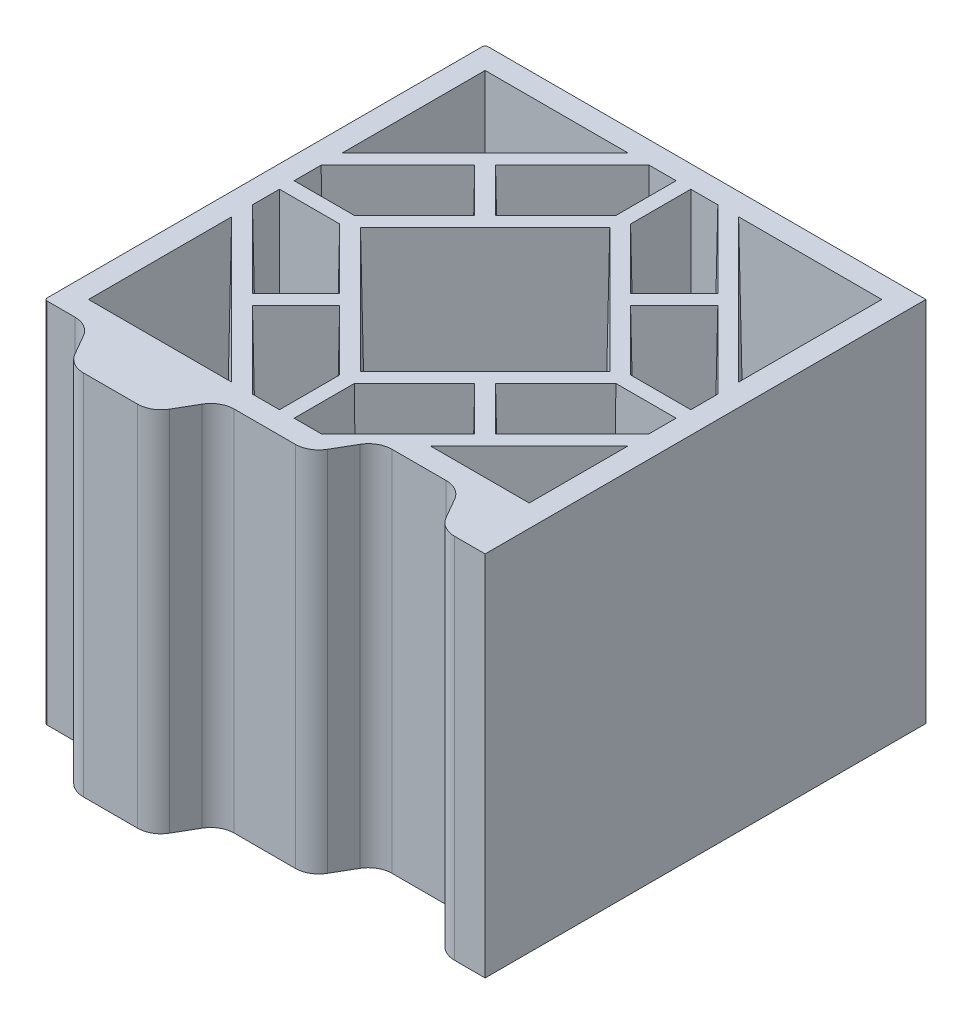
ISO-10303-21;
HEADER;
FILE_DESCRIPTION(('STEP AP214'),'2;1');
FILE_NAME('part.step','',(''),(''),'','','');
FILE_SCHEMA(('AUTOMOTIVE_DESIGN { 1 0 10303 214 1 1 1 1 }'));
ENDSEC;
DATA;
#1=APPLICATION_CONTEXT('core data for automotive mechanical design processes');
#2=APPLICATION_PROTOCOL_DEFINITION('international standard','automotive_design',2000,#1);
#3=PRODUCT_CONTEXT('',#1,'mechanical');
#4=PRODUCT('Part','Part','',(#3));
#5=PRODUCT_RELATED_PRODUCT_CATEGORY('part','',(#4));
#6=PRODUCT_DEFINITION_FORMATION('','',#4);
#7=PRODUCT_DEFINITION_CONTEXT('part definition',#1,'design');
#8=PRODUCT_DEFINITION('design','',#6,#7);
#9=PRODUCT_DEFINITION_SHAPE('','',#8);
#10=(LENGTH_UNIT() NAMED_UNIT(*) SI_UNIT(.MILLI.,.METRE.));
#11=(NAMED_UNIT(*) PLANE_ANGLE_UNIT() SI_UNIT($,.RADIAN.));
#12=(NAMED_UNIT(*) SI_UNIT($,.STERADIAN.) SOLID_ANGLE_UNIT());
#13=UNCERTAINTY_MEASURE_WITH_UNIT(LENGTH_MEASURE(1.E-05),#10,'distance_accuracy_value','');
#14=(GEOMETRIC_REPRESENTATION_CONTEXT(3) GLOBAL_UNCERTAINTY_ASSIGNED_CONTEXT((#13)) GLOBAL_UNIT_ASSIGNED_CONTEXT((#10,
#11,#12)) REPRESENTATION_CONTEXT('',''));
#15=CARTESIAN_POINT('',(0.,0.,0.));
#16=DIRECTION('',(0.,0.,1.));
#17=DIRECTION('',(1.,0.,0.));
#18=AXIS2_PLACEMENT_3D('',#15,#16,#17);
#19=CARTESIAN_POINT('',(12.922102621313,25.,1.59999999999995));
#20=DIRECTION('',(0.,-1.,0.));
#21=DIRECTION('',(0.,0.,-1.));
#22=AXIS2_PLACEMENT_3D('',#19,#20,#21);
#23=PLANE('',#22);
#24=DIRECTION('',(-0.707106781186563,0.,0.707106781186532));
#25=VECTOR('',#24,1.);
#26=CARTESIAN_POINT('',(7.43395744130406,25.,-6.72685066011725));
#27=LINE('',#26,#25);
#28=CARTESIAN_POINT('',(10.4038059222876,25.,-9.69669914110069));
#29=VERTEX_POINT('',#28);
#30=CARTESIAN_POINT('',(7.43395744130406,25.,-6.72685066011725));
#31=VERTEX_POINT('',#30);
#32=EDGE_CURVE('E435',#29,#31,#27,.T.);
#33=ORIENTED_EDGE('',*,*,#32,.F.);
#34=DIRECTION('',(-0.707106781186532,0.,-0.707106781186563));
#35=VECTOR('',#34,1.);
#36=CARTESIAN_POINT('',(10.4038059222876,25.,-9.69669914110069));
#37=LINE('',#36,#35);
#38=CARTESIAN_POINT('',(14.5000000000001,25.,-5.60050506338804));
#39=VERTEX_POINT('',#38);
#40=EDGE_CURVE('E460',#39,#29,#37,.T.);
#41=ORIENTED_EDGE('',*,*,#40,.F.);
#42=DIRECTION('',(0.,0.,-1.));
#43=VECTOR('',#42,1.);
#44=CARTESIAN_POINT('',(14.5000000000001,25.,-5.60050506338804));
#45=LINE('',#44,#43);
#46=CARTESIAN_POINT('',(14.5,25.,-1.49999999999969));
#47=VERTEX_POINT('',#46);
#48=EDGE_CURVE('E908',#47,#39,#45,.T.);
#49=ORIENTED_EDGE('',*,*,#48,.F.);
#50=DIRECTION('',(1.,0.,0.));
#51=VECTOR('',#50,1.);
#52=CARTESIAN_POINT('',(14.5,25.,-1.49999999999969));
#53=LINE('',#52,#51);
#54=CARTESIAN_POINT('',(12.6608081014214,25.,-1.49999999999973));
#55=VERTEX_POINT('',#54);
#56=EDGE_CURVE('E911',#55,#47,#53,.T.);
#57=ORIENTED_EDGE('',*,*,#56,.F.);
#58=DIRECTION('',(0.707106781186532,0.,0.707106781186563));
#59=VECTOR('',#58,1.);
#60=CARTESIAN_POINT('',(12.6608081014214,25.,-1.49999999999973));
#61=LINE('',#60,#59);
#62=EDGE_CURVE('E914',#31,#55,#61,.T.);
#63=ORIENTED_EDGE('',*,*,#62,.F.);
#64=EDGE_LOOP('',(#33,#41,#49,#57,#63));
#65=FACE_BOUND('',#64,.T.);
#66=DIRECTION('',(0.707106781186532,0.,-0.707106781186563));
#67=VECTOR('',#66,1.);
#68=CARTESIAN_POINT('',(17.3391918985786,25.,-1.49999999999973));
#69=LINE('',#68,#67);
#70=CARTESIAN_POINT('',(17.3391918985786,25.,-1.49999999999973));
#71=VERTEX_POINT('',#70);
#72=CARTESIAN_POINT('',(22.5660425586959,25.,-6.72685066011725));
#73=VERTEX_POINT('',#72);
#74=EDGE_CURVE('E288',#71,#73,#69,.T.);
#75=ORIENTED_EDGE('',*,*,#74,.F.);
#76=DIRECTION('',(1.,0.,0.));
#77=VECTOR('',#76,1.);
#78=CARTESIAN_POINT('',(15.5,25.,-1.49999999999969));
#79=LINE('',#78,#77);
#80=CARTESIAN_POINT('',(15.5,25.,-1.49999999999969));
#81=VERTEX_POINT('',#80);
#82=EDGE_CURVE('E293',#81,#71,#79,.T.);
#83=ORIENTED_EDGE('',*,*,#82,.F.);
#84=DIRECTION('',(0.,0.,1.));
#85=VECTOR('',#84,1.);
#86=CARTESIAN_POINT('',(15.4999999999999,25.,-5.60050506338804));
#87=LINE('',#86,#85);
#88=CARTESIAN_POINT('',(15.4999999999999,25.,-5.60050506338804));
#89=VERTEX_POINT('',#88);
#90=EDGE_CURVE('E892',#89,#81,#87,.T.);
#91=ORIENTED_EDGE('',*,*,#90,.F.);
#92=DIRECTION('',(-0.707106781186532,0.,0.707106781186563));
#93=VECTOR('',#92,1.);
#94=CARTESIAN_POINT('',(19.5961940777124,25.,-9.69669914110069));
#95=LINE('',#94,#93);
#96=CARTESIAN_POINT('',(19.5961940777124,25.,-9.69669914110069));
#97=VERTEX_POINT('',#96);
#98=EDGE_CURVE('E265',#97,#89,#95,.T.);
#99=ORIENTED_EDGE('',*,*,#98,.F.);
#100=DIRECTION('',(-0.707106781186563,0.,-0.707106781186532));
#101=VECTOR('',#100,1.);
#102=CARTESIAN_POINT('',(22.5660425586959,25.,-6.72685066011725));
#103=LINE('',#102,#101);
#104=EDGE_CURVE('E895',#73,#97,#103,.T.);
#105=ORIENTED_EDGE('',*,*,#104,.F.);
#106=EDGE_LOOP('',(#75,#83,#91,#99,#105));
#107=FACE_BOUND('',#106,.T.);
#108=DIRECTION('',(0.,0.,-1.));
#109=VECTOR('',#108,1.);
#110=CARTESIAN_POINT('',(28.5,25.,-18.7534054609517));
#111=LINE('',#110,#109);
#112=CARTESIAN_POINT('',(28.5,25.,-18.7534054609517));
#113=VERTEX_POINT('',#112);
#114=CARTESIAN_POINT('',(28.5,25.,-28.5));
#115=VERTEX_POINT('',#114);
#116=EDGE_CURVE('E523',#113,#115,#111,.T.);
#117=ORIENTED_EDGE('',*,*,#116,.F.);
#118=DIRECTION('',(0.707085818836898,0.,0.707127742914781));
#119=VECTOR('',#118,1.);
#120=CARTESIAN_POINT('',(18.7539833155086,25.,-28.5));
#121=LINE('',#120,#119);
#122=CARTESIAN_POINT('',(18.7539833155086,25.,-28.5));
#123=VERTEX_POINT('',#122);
#124=EDGE_CURVE('E530',#123,#113,#121,.T.);
#125=ORIENTED_EDGE('',*,*,#124,.F.);
#126=DIRECTION('',(-1.,0.,0.));
#127=VECTOR('',#126,1.);
#128=CARTESIAN_POINT('',(28.5,25.,-28.5));
#129=LINE('',#128,#127);
#130=EDGE_CURVE('E872',#115,#123,#129,.T.);
#131=ORIENTED_EDGE('',*,*,#130,.F.);
#132=EDGE_LOOP('',(#117,#125,#131));
#133=FACE_BOUND('',#132,.T.);
#134=DIRECTION('',(-0.707106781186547,0.,-0.707106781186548));
#135=VECTOR('',#134,1.);
#136=CARTESIAN_POINT('',(28.5,25.,-17.3391918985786));
#137=LINE('',#136,#135);
#138=CARTESIAN_POINT('',(28.5,25.,-17.3391918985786));
#139=VERTEX_POINT('',#138);
#140=CARTESIAN_POINT('',(23.2731493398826,25.,-22.5660425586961));
#141=VERTEX_POINT('',#140);
#142=EDGE_CURVE('E356',#139,#141,#137,.T.);
#143=ORIENTED_EDGE('',*,*,#142,.F.);
#144=DIRECTION('',(0.,0.,-1.));
#145=VECTOR('',#144,1.);
#146=CARTESIAN_POINT('',(28.5,25.,-15.5));
#147=LINE('',#146,#145);
#148=CARTESIAN_POINT('',(28.5,25.,-15.5));
#149=VERTEX_POINT('',#148);
#150=EDGE_CURVE('E373',#149,#139,#147,.T.);
#151=ORIENTED_EDGE('',*,*,#150,.F.);
#152=DIRECTION('',(1.,0.,0.));
#153=VECTOR('',#152,1.);
#154=CARTESIAN_POINT('',(24.3994949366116,25.,-15.5));
#155=LINE('',#154,#153);
#156=CARTESIAN_POINT('',(24.3994949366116,25.,-15.5));
#157=VERTEX_POINT('',#156);
#158=EDGE_CURVE('E846',#157,#149,#155,.T.);
#159=ORIENTED_EDGE('',*,*,#158,.F.);
#160=DIRECTION('',(0.707106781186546,0.,0.707106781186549));
#161=VECTOR('',#160,1.);
#162=CARTESIAN_POINT('',(20.3033008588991,25.,-19.5961940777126));
#163=LINE('',#162,#161);
#164=CARTESIAN_POINT('',(20.3033008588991,25.,-19.5961940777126));
#165=VERTEX_POINT('',#164);
#166=EDGE_CURVE('E849',#165,#157,#163,.T.);
#167=ORIENTED_EDGE('',*,*,#166,.F.);
#168=DIRECTION('',(-0.70710678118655,0.,0.707106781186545));
#169=VECTOR('',#168,1.);
#170=CARTESIAN_POINT('',(23.2731493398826,25.,-22.5660425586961));
#171=LINE('',#170,#169);
#172=EDGE_CURVE('E852',#141,#165,#171,.T.);
#173=ORIENTED_EDGE('',*,*,#172,.F.);
#174=EDGE_LOOP('',(#143,#151,#159,#167,#173));
#175=FACE_BOUND('',#174,.T.);
#176=DIRECTION('',(-0.707106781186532,0.,0.707106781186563));
#177=VECTOR('',#176,1.);
#178=CARTESIAN_POINT('',(12.6608081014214,25.,-28.5000000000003));
#179=LINE('',#178,#177);
#180=CARTESIAN_POINT('',(12.6608081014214,25.,-28.5000000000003));
#181=VERTEX_POINT('',#180);
#182=CARTESIAN_POINT('',(7.43395744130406,25.,-23.2731493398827));
#183=VERTEX_POINT('',#182);
#184=EDGE_CURVE('E382',#181,#183,#179,.T.);
#185=ORIENTED_EDGE('',*,*,#184,.F.);
#186=DIRECTION('',(-1.,0.,0.));
#187=VECTOR('',#186,1.);
#188=CARTESIAN_POINT('',(14.5,25.,-28.5000000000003));
#189=LINE('',#188,#187);
#190=CARTESIAN_POINT('',(14.5,25.,-28.5000000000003));
#191=VERTEX_POINT('',#190);
#192=EDGE_CURVE('E409',#191,#181,#189,.T.);
#193=ORIENTED_EDGE('',*,*,#192,.F.);
#194=DIRECTION('',(0.,0.,-1.));
#195=VECTOR('',#194,1.);
#196=CARTESIAN_POINT('',(14.5000000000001,25.,-24.399494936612));
#197=LINE('',#196,#195);
#198=CARTESIAN_POINT('',(14.5000000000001,25.,-24.399494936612));
#199=VERTEX_POINT('',#198);
#200=EDGE_CURVE('E823',#199,#191,#197,.T.);
#201=ORIENTED_EDGE('',*,*,#200,.F.);
#202=DIRECTION('',(0.707106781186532,0.,-0.707106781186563));
#203=VECTOR('',#202,1.);
#204=CARTESIAN_POINT('',(10.4038059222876,25.,-20.3033008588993));
#205=LINE('',#204,#203);
#206=CARTESIAN_POINT('',(10.4038059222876,25.,-20.3033008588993));
#207=VERTEX_POINT('',#206);
#208=EDGE_CURVE('E826',#207,#199,#205,.T.);
#209=ORIENTED_EDGE('',*,*,#208,.F.);
#210=DIRECTION('',(0.707106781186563,0.,0.707106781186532));
#211=VECTOR('',#210,1.);
#212=CARTESIAN_POINT('',(7.43395744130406,25.,-23.2731493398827));
#213=LINE('',#212,#211);
#214=EDGE_CURVE('E829',#183,#207,#213,.T.);
#215=ORIENTED_EDGE('',*,*,#214,.F.);
#216=EDGE_LOOP('',(#185,#193,#201,#209,#215));
#217=FACE_BOUND('',#216,.T.);
#218=DIRECTION('',(-1.,0.,0.));
#219=VECTOR('',#218,1.);
#220=CARTESIAN_POINT('',(1.5,25.,-28.5));
#221=LINE('',#220,#219);
#222=CARTESIAN_POINT('',(11.2460166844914,25.,-28.5));
#223=VERTEX_POINT('',#222);
#224=CARTESIAN_POINT('',(1.5,25.,-28.5));
#225=VERTEX_POINT('',#224);
#226=EDGE_CURVE('E566',#223,#225,#221,.T.);
#227=ORIENTED_EDGE('',*,*,#226,.F.);
#228=DIRECTION('',(0.707085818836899,0.,-0.707127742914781));
#229=VECTOR('',#228,1.);
#230=CARTESIAN_POINT('',(11.2460166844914,25.,-28.5));
#231=LINE('',#230,#229);
#232=CARTESIAN_POINT('',(1.49999999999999,25.,-18.7534054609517));
#233=VERTEX_POINT('',#232);
#234=EDGE_CURVE('E581',#233,#223,#231,.T.);
#235=ORIENTED_EDGE('',*,*,#234,.F.);
#236=DIRECTION('',(0.,0.,1.));
#237=VECTOR('',#236,1.);
#238=CARTESIAN_POINT('',(1.5,25.,-18.7534054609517));
#239=LINE('',#238,#237);
#240=EDGE_CURVE('E803',#225,#233,#239,.T.);
#241=ORIENTED_EDGE('',*,*,#240,.F.);
#242=EDGE_LOOP('',(#227,#235,#241));
#243=FACE_BOUND('',#242,.T.);
#244=CARTESIAN_POINT('',(12.922102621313,25.,1.59999999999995));
#245=DIRECTION('',(0.,-1.,0.));
#246=DIRECTION('',(0.,0.,-1.));
#247=AXIS2_PLACEMENT_3D('',#244,#245,#246);
#248=CIRCLE('',#247,1.59999999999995);
#249=CARTESIAN_POINT('',(11.5377075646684,25.,0.797846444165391));
#250=VERTEX_POINT('',#249);
#251=CARTESIAN_POINT('',(12.922102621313,25.,0.));
#252=VERTEX_POINT('',#251);
#253=EDGE_CURVE('E726',#250,#252,#248,.T.);
#254=ORIENTED_EDGE('',*,*,#253,.T.);
#255=DIRECTION('',(1.,0.,0.));
#256=VECTOR('',#255,1.);
#257=CARTESIAN_POINT('',(12.922102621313,25.,0.));
#258=LINE('',#257,#256);
#259=CARTESIAN_POINT('',(17.077897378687,25.,0.));
#260=VERTEX_POINT('',#259);
#261=EDGE_CURVE('E723',#252,#260,#258,.T.);
#262=ORIENTED_EDGE('',*,*,#261,.T.);
#263=CARTESIAN_POINT('',(17.077897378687,25.,-1.59999999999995));
#264=DIRECTION('',(0.,1.,0.));
#265=DIRECTION('',(0.,0.,-1.));
#266=AXIS2_PLACEMENT_3D('',#263,#264,#265);
#267=CIRCLE('',#266,1.6);
#268=CARTESIAN_POINT('',(18.4622924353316,25.,-0.797846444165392));
#269=VERTEX_POINT('',#268);
#270=EDGE_CURVE('E720',#260,#269,#267,.T.);
#271=ORIENTED_EDGE('',*,*,#270,.T.);
#272=DIRECTION('',(0.501345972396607,0.,-0.865246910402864));
#273=VECTOR('',#272,1.);
#274=CARTESIAN_POINT('',(19.2759835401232,25.,-2.20215355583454));
#275=LINE('',#274,#273);
#276=CARTESIAN_POINT('',(19.2759835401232,25.,-2.20215355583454));
#277=VERTEX_POINT('',#276);
#278=EDGE_CURVE('E717',#269,#277,#275,.T.);
#279=ORIENTED_EDGE('',*,*,#278,.T.);
#280=CARTESIAN_POINT('',(20.6603785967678,25.,-1.39999999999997));
#281=DIRECTION('',(0.,-1.,0.));
#282=DIRECTION('',(0.,0.,1.));
#283=AXIS2_PLACEMENT_3D('',#280,#281,#282);
#284=CIRCLE('',#283,1.6);
#285=CARTESIAN_POINT('',(20.6603785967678,25.,-2.99999999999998));
#286=VERTEX_POINT('',#285);
#287=EDGE_CURVE('E714',#277,#286,#284,.T.);
#288=ORIENTED_EDGE('',*,*,#287,.T.);
#289=DIRECTION('',(1.,0.,0.));
#290=VECTOR('',#289,1.);
#291=CARTESIAN_POINT('',(24.3441887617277,25.,-2.99999999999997));
#292=LINE('',#291,#290);
#293=CARTESIAN_POINT('',(24.3441887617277,25.,-2.99999999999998));
#294=VERTEX_POINT('',#293);
#295=EDGE_CURVE('E711',#286,#294,#292,.T.);
#296=ORIENTED_EDGE('',*,*,#295,.T.);
#297=CARTESIAN_POINT('',(24.3441887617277,25.,-1.39999999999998));
#298=DIRECTION('',(0.,-1.,0.));
#299=DIRECTION('',(0.,0.,1.));
#300=AXIS2_PLACEMENT_3D('',#297,#298,#299);
#301=CIRCLE('',#300,1.59999999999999);
#302=CARTESIAN_POINT('',(25.7298294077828,25.,-2.19999999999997));
#303=VERTEX_POINT('',#302);
#304=EDGE_CURVE('E708',#294,#303,#301,.T.);
#305=ORIENTED_EDGE('',*,*,#304,.T.);
#306=DIRECTION('',(0.499999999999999,0.,0.866025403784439));
#307=VECTOR('',#306,1.);
#308=CARTESIAN_POINT('',(26.5381197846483,25.,-0.8));
#309=LINE('',#308,#307);
#310=CARTESIAN_POINT('',(26.5381197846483,25.,-0.800000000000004));
#311=VERTEX_POINT('',#310);
#312=EDGE_CURVE('E705',#303,#311,#309,.T.);
#313=ORIENTED_EDGE('',*,*,#312,.T.);
#314=CARTESIAN_POINT('',(27.9237604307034,25.,-1.59999999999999));
#315=DIRECTION('',(0.,1.,0.));
#316=DIRECTION('',(0.,0.,-1.));
#317=AXIS2_PLACEMENT_3D('',#314,#315,#316);
#318=CIRCLE('',#317,1.59999999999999);
#319=CARTESIAN_POINT('',(27.9237604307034,25.,0.));
#320=VERTEX_POINT('',#319);
#321=EDGE_CURVE('E702',#311,#320,#318,.T.);
#322=ORIENTED_EDGE('',*,*,#321,.T.);
#323=DIRECTION('',(1.,0.,0.));
#324=VECTOR('',#323,1.);
#325=CARTESIAN_POINT('',(27.9237604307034,25.,0.));
#326=LINE('',#325,#324);
#327=CARTESIAN_POINT('',(30.,25.,0.));
#328=VERTEX_POINT('',#327);
#329=EDGE_CURVE('E699',#320,#328,#326,.T.);
#330=ORIENTED_EDGE('',*,*,#329,.T.);
#331=DIRECTION('',(0.,0.,-1.));
#332=VECTOR('',#331,1.);
#333=CARTESIAN_POINT('',(30.,25.,-30.));
#334=LINE('',#333,#332);
#335=CARTESIAN_POINT('',(30.,25.,-30.));
#336=VERTEX_POINT('',#335);
#337=EDGE_CURVE('E696',#328,#336,#334,.T.);
#338=ORIENTED_EDGE('',*,*,#337,.T.);
#339=DIRECTION('',(-1.,0.,0.));
#340=VECTOR('',#339,1.);
#341=CARTESIAN_POINT('',(0.200000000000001,25.,-30.));
#342=LINE('',#341,#340);
#343=CARTESIAN_POINT('',(0.200000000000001,25.,-30.));
#344=VERTEX_POINT('',#343);
#345=EDGE_CURVE('E693',#336,#344,#342,.T.);
#346=ORIENTED_EDGE('',*,*,#345,.T.);
#347=CARTESIAN_POINT('',(0.2,25.,-29.8));
#348=DIRECTION('',(0.,1.,0.));
#349=DIRECTION('',(0.,0.,-1.));
#350=AXIS2_PLACEMENT_3D('',#347,#348,#349);
#351=CIRCLE('',#350,0.199999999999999);
#352=CARTESIAN_POINT('',(0.,25.,-29.8));
#353=VERTEX_POINT('',#352);
#354=EDGE_CURVE('E690',#344,#353,#351,.T.);
#355=ORIENTED_EDGE('',*,*,#354,.T.);
#356=DIRECTION('',(0.,0.,1.));
#357=VECTOR('',#356,1.);
#358=CARTESIAN_POINT('',(0.,25.,-0.200000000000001));
#359=LINE('',#358,#357);
#360=CARTESIAN_POINT('',(0.,25.,-0.200000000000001));
#361=VERTEX_POINT('',#360);
#362=EDGE_CURVE('E687',#353,#361,#359,.T.);
#363=ORIENTED_EDGE('',*,*,#362,.T.);
#364=CARTESIAN_POINT('',(0.2,25.,-0.2));
#365=DIRECTION('',(0.,1.,0.));
#366=DIRECTION('',(0.,0.,-1.));
#367=AXIS2_PLACEMENT_3D('',#364,#365,#366);
#368=CIRCLE('',#367,0.2);
#369=CARTESIAN_POINT('',(0.200000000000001,25.,0.));
#370=VERTEX_POINT('',#369);
#371=EDGE_CURVE('E684',#361,#370,#368,.T.);
#372=ORIENTED_EDGE('',*,*,#371,.T.);
#373=DIRECTION('',(1.,0.,0.));
#374=VECTOR('',#373,1.);
#375=CARTESIAN_POINT('',(2.07623956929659,25.,0.));
#376=LINE('',#375,#374);
#377=CARTESIAN_POINT('',(2.07623956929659,25.,0.));
#378=VERTEX_POINT('',#377);
#379=EDGE_CURVE('E681',#370,#378,#376,.T.);
#380=ORIENTED_EDGE('',*,*,#379,.T.);
#381=CARTESIAN_POINT('',(2.0762395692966,25.,1.59999999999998));
#382=DIRECTION('',(0.,-1.,0.));
#383=DIRECTION('',(0.,0.,-1.));
#384=AXIS2_PLACEMENT_3D('',#381,#382,#383);
#385=CIRCLE('',#384,1.59999999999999);
#386=CARTESIAN_POINT('',(3.4618802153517,25.,0.799999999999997));
#387=VERTEX_POINT('',#386);
#388=EDGE_CURVE('E678',#378,#387,#385,.T.);
#389=ORIENTED_EDGE('',*,*,#388,.T.);
#390=DIRECTION('',(0.5,0.,0.866025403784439));
#391=VECTOR('',#390,1.);
#392=CARTESIAN_POINT('',(3.4618802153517,25.,0.799999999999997));
#393=LINE('',#392,#391);
#394=CARTESIAN_POINT('',(4.27017059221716,25.,2.19999999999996));
#395=VERTEX_POINT('',#394);
#396=EDGE_CURVE('E675',#387,#395,#393,.T.);
#397=ORIENTED_EDGE('',*,*,#396,.T.);
#398=CARTESIAN_POINT('',(5.65581123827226,25.,1.39999999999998));
#399=DIRECTION('',(0.,1.,0.));
#400=DIRECTION('',(0.,0.,1.));
#401=AXIS2_PLACEMENT_3D('',#398,#399,#400);
#402=CIRCLE('',#401,1.59999999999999);
#403=CARTESIAN_POINT('',(5.65581123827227,25.,2.99999999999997));
#404=VERTEX_POINT('',#403);
#405=EDGE_CURVE('E672',#395,#404,#402,.T.);
#406=ORIENTED_EDGE('',*,*,#405,.T.);
#407=DIRECTION('',(1.,0.,0.));
#408=VECTOR('',#407,1.);
#409=CARTESIAN_POINT('',(5.65581123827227,25.,2.99999999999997));
#410=LINE('',#409,#408);
#411=CARTESIAN_POINT('',(9.33962140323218,25.,2.99999999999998));
#412=VERTEX_POINT('',#411);
#413=EDGE_CURVE('E669',#404,#412,#410,.T.);
#414=ORIENTED_EDGE('',*,*,#413,.T.);
#415=CARTESIAN_POINT('',(9.33962140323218,25.,1.39999999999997));
#416=DIRECTION('',(0.,1.,0.));
#417=DIRECTION('',(0.,0.,1.));
#418=AXIS2_PLACEMENT_3D('',#415,#416,#417);
#419=CIRCLE('',#418,1.6);
#420=CARTESIAN_POINT('',(10.7240164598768,25.,2.20215355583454));
#421=VERTEX_POINT('',#420);
#422=EDGE_CURVE('E666',#412,#421,#419,.T.);
#423=ORIENTED_EDGE('',*,*,#422,.T.);
#424=DIRECTION('',(0.501345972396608,0.,-0.865246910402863));
#425=VECTOR('',#424,1.);
#426=CARTESIAN_POINT('',(10.7240164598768,25.,2.20215355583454));
#427=LINE('',#426,#425);
#428=EDGE_CURVE('E663',#421,#250,#427,.T.);
#429=ORIENTED_EDGE('',*,*,#428,.T.);
#430=EDGE_LOOP('',(#254,#262,#271,#279,#288,#296,#305,#313,#322,#330,#338,#346,#355,#363,#372,
#380,#389,#397,#406,#414,#423,#429));
#431=FACE_BOUND('',#430,.T.);
#432=DIRECTION('',(0.,0.,1.));
#433=VECTOR('',#432,1.);
#434=CARTESIAN_POINT('',(1.5,25.,-11.2465945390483));
#435=LINE('',#434,#433);
#436=CARTESIAN_POINT('',(1.5,25.,-11.2465945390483));
#437=VERTEX_POINT('',#436);
#438=CARTESIAN_POINT('',(1.5,25.,-1.5));
#439=VERTEX_POINT('',#438);
#440=EDGE_CURVE('E588',#437,#439,#435,.T.);
#441=ORIENTED_EDGE('',*,*,#440,.F.);
#442=DIRECTION('',(-0.707085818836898,0.,-0.707127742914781));
#443=VECTOR('',#442,1.);
#444=CARTESIAN_POINT('',(11.2460166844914,25.,-1.5));
#445=LINE('',#444,#443);
#446=CARTESIAN_POINT('',(11.2460166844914,25.,-1.5));
#447=VERTEX_POINT('',#446);
#448=EDGE_CURVE('E595',#447,#437,#445,.T.);
#449=ORIENTED_EDGE('',*,*,#448,.F.);
#450=DIRECTION('',(1.,0.,0.));
#451=VECTOR('',#450,1.);
#452=CARTESIAN_POINT('',(1.5,25.,-1.5));
#453=LINE('',#452,#451);
#454=EDGE_CURVE('E796',#439,#447,#453,.T.);
#455=ORIENTED_EDGE('',*,*,#454,.F.);
#456=EDGE_LOOP('',(#441,#449,#455));
#457=FACE_BOUND('',#456,.T.);
#458=DIRECTION('',(1.,0.,0.));
#459=VECTOR('',#458,1.);
#460=CARTESIAN_POINT('',(5.60050506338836,25.,-15.5));
#461=LINE('',#460,#459);
#462=CARTESIAN_POINT('',(1.5,25.,-15.5));
#463=VERTEX_POINT('',#462);
#464=CARTESIAN_POINT('',(5.60050506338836,25.,-15.5));
#465=VERTEX_POINT('',#464);
#466=EDGE_CURVE('E500',#463,#465,#461,.T.);
#467=ORIENTED_EDGE('',*,*,#466,.F.);
#468=DIRECTION('',(0.,0.,1.));
#469=VECTOR('',#468,1.);
#470=CARTESIAN_POINT('',(1.5,25.,-15.5));
#471=LINE('',#470,#469);
#472=CARTESIAN_POINT('',(1.5,25.,-17.3391918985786));
#473=VERTEX_POINT('',#472);
#474=EDGE_CURVE('E507',#473,#463,#471,.T.);
#475=ORIENTED_EDGE('',*,*,#474,.F.);
#476=DIRECTION('',(-0.707106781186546,0.,0.707106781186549));
#477=VECTOR('',#476,1.);
#478=CARTESIAN_POINT('',(1.5,25.,-17.3391918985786));
#479=LINE('',#478,#477);
#480=CARTESIAN_POINT('',(6.7268506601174,25.,-22.5660425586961));
#481=VERTEX_POINT('',#480);
#482=EDGE_CURVE('E810',#481,#473,#479,.T.);
#483=ORIENTED_EDGE('',*,*,#482,.F.);
#484=DIRECTION('',(-0.707106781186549,0.,-0.707106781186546));
#485=VECTOR('',#484,1.);
#486=CARTESIAN_POINT('',(6.7268506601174,25.,-22.5660425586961));
#487=LINE('',#486,#485);
#488=CARTESIAN_POINT('',(9.6966991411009,25.,-19.5961940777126));
#489=VERTEX_POINT('',#488);
#490=EDGE_CURVE('E813',#489,#481,#487,.T.);
#491=ORIENTED_EDGE('',*,*,#490,.F.);
#492=DIRECTION('',(0.707106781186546,0.,-0.707106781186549));
#493=VECTOR('',#492,1.);
#494=CARTESIAN_POINT('',(9.6966991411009,25.,-19.5961940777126));
#495=LINE('',#494,#493);
#496=EDGE_CURVE('E816',#465,#489,#495,.T.);
#497=ORIENTED_EDGE('',*,*,#496,.F.);
#498=EDGE_LOOP('',(#467,#475,#483,#491,#497));
#499=FACE_BOUND('',#498,.T.);
#500=DIRECTION('',(0.707106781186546,0.,0.707106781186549));
#501=VECTOR('',#500,1.);
#502=CARTESIAN_POINT('',(6.51471862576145,25.,-15.));
#503=LINE('',#502,#501);
#504=CARTESIAN_POINT('',(6.51471862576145,25.,-15.));
#505=VERTEX_POINT('',#504);
#506=CARTESIAN_POINT('',(15.,25.,-6.51471862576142));
#507=VERTEX_POINT('',#506);
#508=EDGE_CURVE('E421',#505,#507,#503,.T.);
#509=ORIENTED_EDGE('',*,*,#508,.F.);
#510=DIRECTION('',(-0.707106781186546,0.,0.707106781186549));
#511=VECTOR('',#510,1.);
#512=CARTESIAN_POINT('',(6.51471862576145,25.,-15.));
#513=LINE('',#512,#511);
#514=CARTESIAN_POINT('',(15.,25.,-23.4852813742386));
#515=VERTEX_POINT('',#514);
#516=EDGE_CURVE('E430',#515,#505,#513,.T.);
#517=ORIENTED_EDGE('',*,*,#516,.F.);
#518=DIRECTION('',(-0.707106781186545,0.,-0.70710678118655));
#519=VECTOR('',#518,1.);
#520=CARTESIAN_POINT('',(15.,25.,-23.4852813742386));
#521=LINE('',#520,#519);
#522=CARTESIAN_POINT('',(23.4852813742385,25.,-15.));
#523=VERTEX_POINT('',#522);
#524=EDGE_CURVE('E836',#523,#515,#521,.T.);
#525=ORIENTED_EDGE('',*,*,#524,.F.);
#526=DIRECTION('',(0.707106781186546,0.,-0.707106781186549));
#527=VECTOR('',#526,1.);
#528=CARTESIAN_POINT('',(15.,25.,-6.51471862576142));
#529=LINE('',#528,#527);
#530=EDGE_CURVE('E839',#507,#523,#529,.T.);
#531=ORIENTED_EDGE('',*,*,#530,.F.);
#532=EDGE_LOOP('',(#509,#517,#525,#531));
#533=FACE_BOUND('',#532,.T.);
#534=DIRECTION('',(0.707106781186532,0.,0.707106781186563));
#535=VECTOR('',#534,1.);
#536=CARTESIAN_POINT('',(19.5961940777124,25.,-20.3033008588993));
#537=LINE('',#536,#535);
#538=CARTESIAN_POINT('',(15.4999999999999,25.,-24.399494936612));
#539=VERTEX_POINT('',#538);
#540=CARTESIAN_POINT('',(19.5961940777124,25.,-20.3033008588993));
#541=VERTEX_POINT('',#540);
#542=EDGE_CURVE('E550',#539,#541,#537,.T.);
#543=ORIENTED_EDGE('',*,*,#542,.F.);
#544=DIRECTION('',(0.,0.,1.));
#545=VECTOR('',#544,1.);
#546=CARTESIAN_POINT('',(15.4999999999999,25.,-24.399494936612));
#547=LINE('',#546,#545);
#548=CARTESIAN_POINT('',(15.5,25.,-28.5000000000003));
#549=VERTEX_POINT('',#548);
#550=EDGE_CURVE('E561',#549,#539,#547,.T.);
#551=ORIENTED_EDGE('',*,*,#550,.F.);
#552=DIRECTION('',(-1.,0.,0.));
#553=VECTOR('',#552,1.);
#554=CARTESIAN_POINT('',(15.5,25.,-28.5000000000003));
#555=LINE('',#554,#553);
#556=CARTESIAN_POINT('',(17.3391918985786,25.,-28.5000000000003));
#557=VERTEX_POINT('',#556);
#558=EDGE_CURVE('E859',#557,#549,#555,.T.);
#559=ORIENTED_EDGE('',*,*,#558,.F.);
#560=DIRECTION('',(-0.707106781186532,0.,-0.707106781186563));
#561=VECTOR('',#560,1.);
#562=CARTESIAN_POINT('',(17.3391918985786,25.,-28.5000000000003));
#563=LINE('',#562,#561);
#564=CARTESIAN_POINT('',(22.5660425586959,25.,-23.2731493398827));
#565=VERTEX_POINT('',#564);
#566=EDGE_CURVE('E862',#565,#557,#563,.T.);
#567=ORIENTED_EDGE('',*,*,#566,.F.);
#568=DIRECTION('',(0.707106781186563,0.,-0.707106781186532));
#569=VECTOR('',#568,1.);
#570=CARTESIAN_POINT('',(22.5660425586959,25.,-23.2731493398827));
#571=LINE('',#570,#569);
#572=EDGE_CURVE('E865',#541,#565,#571,.T.);
#573=ORIENTED_EDGE('',*,*,#572,.F.);
#574=EDGE_LOOP('',(#543,#551,#559,#567,#573));
#575=FACE_BOUND('',#574,.T.);
#576=DIRECTION('',(-0.707106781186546,0.,0.707106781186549));
#577=VECTOR('',#576,1.);
#578=CARTESIAN_POINT('',(20.3033008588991,25.,-10.4038059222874));
#579=LINE('',#578,#577);
#580=CARTESIAN_POINT('',(24.3994949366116,25.,-14.5));
#581=VERTEX_POINT('',#580);
#582=CARTESIAN_POINT('',(20.3033008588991,25.,-10.4038059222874));
#583=VERTEX_POINT('',#582);
#584=EDGE_CURVE('E322',#581,#583,#579,.T.);
#585=ORIENTED_EDGE('',*,*,#584,.F.);
#586=DIRECTION('',(-1.,0.,0.));
#587=VECTOR('',#586,1.);
#588=CARTESIAN_POINT('',(24.3994949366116,25.,-14.5));
#589=LINE('',#588,#587);
#590=CARTESIAN_POINT('',(28.5,25.,-14.5));
#591=VERTEX_POINT('',#590);
#592=EDGE_CURVE('E347',#591,#581,#589,.T.);
#593=ORIENTED_EDGE('',*,*,#592,.F.);
#594=DIRECTION('',(0.,0.,-1.));
#595=VECTOR('',#594,1.);
#596=CARTESIAN_POINT('',(28.5,25.,-14.5));
#597=LINE('',#596,#595);
#598=CARTESIAN_POINT('',(28.5,25.,-12.6608081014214));
#599=VERTEX_POINT('',#598);
#600=EDGE_CURVE('E879',#599,#591,#597,.T.);
#601=ORIENTED_EDGE('',*,*,#600,.F.);
#602=DIRECTION('',(0.707106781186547,0.,-0.707106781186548));
#603=VECTOR('',#602,1.);
#604=CARTESIAN_POINT('',(28.5,25.,-12.6608081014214));
#605=LINE('',#604,#603);
#606=CARTESIAN_POINT('',(23.2731493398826,25.,-7.43395744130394));
#607=VERTEX_POINT('',#606);
#608=EDGE_CURVE('E882',#607,#599,#605,.T.);
#609=ORIENTED_EDGE('',*,*,#608,.F.);
#610=DIRECTION('',(0.70710678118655,0.,0.707106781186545));
#611=VECTOR('',#610,1.);
#612=CARTESIAN_POINT('',(23.2731493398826,25.,-7.43395744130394));
#613=LINE('',#612,#611);
#614=EDGE_CURVE('E885',#583,#607,#613,.T.);
#615=ORIENTED_EDGE('',*,*,#614,.F.);
#616=EDGE_LOOP('',(#585,#593,#601,#609,#615));
#617=FACE_BOUND('',#616,.T.);
#618=DIRECTION('',(-0.707085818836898,0.,0.707127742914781));
#619=VECTOR('',#618,1.);
#620=CARTESIAN_POINT('',(21.7538054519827,25.,-4.5));
#621=LINE('',#620,#619);
#622=CARTESIAN_POINT('',(28.5,25.,-11.2465945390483));
#623=VERTEX_POINT('',#622);
#624=CARTESIAN_POINT('',(21.7538054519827,25.,-4.5));
#625=VERTEX_POINT('',#624);
#626=EDGE_CURVE('E303',#623,#625,#621,.T.);
#627=ORIENTED_EDGE('',*,*,#626,.F.);
#628=DIRECTION('',(0.,0.,-1.));
#629=VECTOR('',#628,1.);
#630=CARTESIAN_POINT('',(28.5,25.,-11.2465945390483));
#631=LINE('',#630,#629);
#632=CARTESIAN_POINT('',(28.5,25.,-4.5));
#633=VERTEX_POINT('',#632);
#634=EDGE_CURVE('E318',#633,#623,#631,.T.);
#635=ORIENTED_EDGE('',*,*,#634,.F.);
#636=DIRECTION('',(1.,0.,0.));
#637=VECTOR('',#636,1.);
#638=CARTESIAN_POINT('',(21.7538054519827,25.,-4.5));
#639=LINE('',#638,#637);
#640=EDGE_CURVE('E901',#625,#633,#639,.T.);
#641=ORIENTED_EDGE('',*,*,#640,.F.);
#642=EDGE_LOOP('',(#627,#635,#641));
#643=FACE_BOUND('',#642,.T.);
#644=DIRECTION('',(0.707106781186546,0.,0.707106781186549));
#645=VECTOR('',#644,1.);
#646=CARTESIAN_POINT('',(1.5,25.,-12.6608081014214));
#647=LINE('',#646,#645);
#648=CARTESIAN_POINT('',(1.5,25.,-12.6608081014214));
#649=VERTEX_POINT('',#648);
#650=CARTESIAN_POINT('',(6.7268506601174,25.,-7.43395744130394));
#651=VERTEX_POINT('',#650);
#652=EDGE_CURVE('E474',#649,#651,#647,.T.);
#653=ORIENTED_EDGE('',*,*,#652,.F.);
#654=DIRECTION('',(0.,0.,1.));
#655=VECTOR('',#654,1.);
#656=CARTESIAN_POINT('',(1.5,25.,-14.5));
#657=LINE('',#656,#655);
#658=CARTESIAN_POINT('',(1.5,25.,-14.5));
#659=VERTEX_POINT('',#658);
#660=EDGE_CURVE('E480',#659,#649,#657,.T.);
#661=ORIENTED_EDGE('',*,*,#660,.F.);
#662=DIRECTION('',(-1.,0.,0.));
#663=VECTOR('',#662,1.);
#664=CARTESIAN_POINT('',(5.60050506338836,25.,-14.5));
#665=LINE('',#664,#663);
#666=CARTESIAN_POINT('',(5.60050506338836,25.,-14.5));
#667=VERTEX_POINT('',#666);
#668=EDGE_CURVE('E920',#667,#659,#665,.T.);
#669=ORIENTED_EDGE('',*,*,#668,.F.);
#670=DIRECTION('',(-0.707106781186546,0.,-0.707106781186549));
#671=VECTOR('',#670,1.);
#672=CARTESIAN_POINT('',(9.6966991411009,25.,-10.4038059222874));
#673=LINE('',#672,#671);
#674=CARTESIAN_POINT('',(9.6966991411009,25.,-10.4038059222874));
#675=VERTEX_POINT('',#674);
#676=EDGE_CURVE('E922',#675,#667,#673,.T.);
#677=ORIENTED_EDGE('',*,*,#676,.F.);
#678=DIRECTION('',(0.707106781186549,0.,-0.707106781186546));
#679=VECTOR('',#678,1.);
#680=CARTESIAN_POINT('',(6.7268506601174,25.,-7.43395744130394));
#681=LINE('',#680,#679);
#682=EDGE_CURVE('E925',#651,#675,#681,.T.);
#683=ORIENTED_EDGE('',*,*,#682,.F.);
#684=EDGE_LOOP('',(#653,#661,#669,#677,#683));
#685=FACE_BOUND('',#684,.T.);
#686=ADVANCED_FACE('F26',(#65,#107,#133,#175,#217,#243,#431,#457,#499,#533,#575,#617,#643,#685),
#23,.F.);
#687=CARTESIAN_POINT('',(12.922102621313,0.,1.59999999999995));
#688=DIRECTION('',(0.,-1.,0.));
#689=DIRECTION('',(0.,0.,-1.));
#690=AXIS2_PLACEMENT_3D('',#687,#688,#689);
#691=PLANE('',#690);
#692=DIRECTION('',(-0.707106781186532,0.,-0.707106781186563));
#693=VECTOR('',#692,1.);
#694=CARTESIAN_POINT('',(17.0027389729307,0.,-2.48063635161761));
#695=LINE('',#694,#693);
#696=CARTESIAN_POINT('',(14.0636233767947,0.,-5.41975194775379));
#697=VERTEX_POINT('',#696);
#698=CARTESIAN_POINT('',(10.4038059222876,0.,-9.07956940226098));
#699=VERTEX_POINT('',#698);
#700=EDGE_CURVE('E432',#697,#699,#695,.T.);
#701=ORIENTED_EDGE('',*,*,#700,.T.);
#702=DIRECTION('',(-0.707106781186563,0.,0.707106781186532));
#703=VECTOR('',#702,1.);
#704=CARTESIAN_POINT('',(6.32316957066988,0.,-4.99893305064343));
#705=LINE('',#704,#703);
#706=CARTESIAN_POINT('',(8.05108718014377,0.,-6.72685066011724));
#707=VERTEX_POINT('',#706);
#708=EDGE_CURVE('E445',#699,#707,#705,.T.);
#709=ORIENTED_EDGE('',*,*,#708,.T.);
#710=DIRECTION('',(0.707106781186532,0.,0.707106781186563));
#711=VECTOR('',#710,1.);
#712=CARTESIAN_POINT('',(14.6500202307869,0.,-0.127917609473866));
#713=LINE('',#712,#711);
#714=CARTESIAN_POINT('',(12.8415612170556,0.,-1.93637662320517));
#715=VERTEX_POINT('',#714);
#716=EDGE_CURVE('E442',#707,#715,#713,.T.);
#717=ORIENTED_EDGE('',*,*,#716,.T.);
#718=DIRECTION('',(1.,0.,0.));
#719=VECTOR('',#718,1.);
#720=CARTESIAN_POINT('',(12.9221026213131,0.,-1.93637662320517));
#721=LINE('',#720,#719);
#722=CARTESIAN_POINT('',(14.0636233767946,0.,-1.93637662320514));
#723=VERTEX_POINT('',#722);
#724=EDGE_CURVE('E439',#715,#723,#721,.T.);
#725=ORIENTED_EDGE('',*,*,#724,.T.);
#726=DIRECTION('',(0.,0.,-1.));
#727=VECTOR('',#726,1.);
#728=CARTESIAN_POINT('',(14.0636233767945,0.,1.59999999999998));
#729=LINE('',#728,#727);
#730=EDGE_CURVE('E436',#723,#697,#729,.T.);
#731=ORIENTED_EDGE('',*,*,#730,.T.);
#732=EDGE_LOOP('',(#701,#709,#717,#725,#731));
#733=FACE_BOUND('',#732,.T.);
#734=DIRECTION('',(1.,0.,0.));
#735=VECTOR('',#734,1.);
#736=CARTESIAN_POINT('',(12.9221026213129,0.,-1.93637662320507));
#737=LINE('',#736,#735);
#738=CARTESIAN_POINT('',(15.9363766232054,0.,-1.93637662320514));
#739=VERTEX_POINT('',#738);
#740=CARTESIAN_POINT('',(17.1584387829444,0.,-1.93637662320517));
#741=VERTEX_POINT('',#740);
#742=EDGE_CURVE('E278',#739,#741,#737,.T.);
#743=ORIENTED_EDGE('',*,*,#742,.T.);
#744=DIRECTION('',(0.707106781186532,0.,-0.707106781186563));
#745=VECTOR('',#744,1.);
#746=CARTESIAN_POINT('',(13.2720823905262,0.,1.94997976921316));
#747=LINE('',#746,#745);
#748=CARTESIAN_POINT('',(21.9489128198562,0.,-6.72685066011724));
#749=VERTEX_POINT('',#748);
#750=EDGE_CURVE('E284',#741,#749,#747,.T.);
#751=ORIENTED_EDGE('',*,*,#750,.T.);
#752=DIRECTION('',(-0.707106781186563,0.,-0.707106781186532));
#753=VECTOR('',#752,1.);
#754=CARTESIAN_POINT('',(21.598933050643,0.,-7.07683042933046));
#755=LINE('',#754,#753);
#756=CARTESIAN_POINT('',(19.5961940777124,0.,-9.07956940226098));
#757=VERTEX_POINT('',#756);
#758=EDGE_CURVE('E283',#749,#757,#755,.T.);
#759=ORIENTED_EDGE('',*,*,#758,.T.);
#760=DIRECTION('',(-0.707106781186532,0.,0.707106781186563));
#761=VECTOR('',#760,1.);
#762=CARTESIAN_POINT('',(10.9193636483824,0.,-0.402738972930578));
#763=LINE('',#762,#761);
#764=CARTESIAN_POINT('',(15.9363766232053,0.,-5.41975194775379));
#765=VERTEX_POINT('',#764);
#766=EDGE_CURVE('E30',#757,#765,#763,.T.);
#767=ORIENTED_EDGE('',*,*,#766,.T.);
#768=DIRECTION('',(0.,0.,1.));
#769=VECTOR('',#768,1.);
#770=CARTESIAN_POINT('',(15.9363766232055,0.,1.59999999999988));
#771=LINE('',#770,#769);
#772=EDGE_CURVE('E272',#765,#739,#771,.T.);
#773=ORIENTED_EDGE('',*,*,#772,.T.);
#774=EDGE_LOOP('',(#743,#751,#759,#767,#773));
#775=FACE_BOUND('',#774,.T.);
#776=DIRECTION('',(0.707085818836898,0.,0.707127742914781));
#777=VECTOR('',#776,1.);
#778=CARTESIAN_POINT('',(31.1967898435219,0.,-16.6736037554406));
#779=LINE('',#778,#777);
#780=CARTESIAN_POINT('',(19.8074455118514,0.,-28.0636233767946));
#781=VERTEX_POINT('',#780);
#782=CARTESIAN_POINT('',(28.0636233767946,0.,-19.8069559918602));
#783=VERTEX_POINT('',#782);
#784=EDGE_CURVE('E520',#781,#783,#779,.T.);
#785=ORIENTED_EDGE('',*,*,#784,.T.);
#786=DIRECTION('',(0.,0.,-1.));
#787=VECTOR('',#786,1.);
#788=CARTESIAN_POINT('',(28.0636233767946,0.,1.59999999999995));
#789=LINE('',#788,#787);
#790=CARTESIAN_POINT('',(28.0636233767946,0.,-28.0636233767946));
#791=VERTEX_POINT('',#790);
#792=EDGE_CURVE('E344',#783,#791,#789,.T.);
#793=ORIENTED_EDGE('',*,*,#792,.T.);
#794=DIRECTION('',(-1.,0.,0.));
#795=VECTOR('',#794,1.);
#796=CARTESIAN_POINT('',(12.922102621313,0.,-28.0636233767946));
#797=LINE('',#796,#795);
#798=EDGE_CURVE('E519',#791,#781,#797,.T.);
#799=ORIENTED_EDGE('',*,*,#798,.T.);
#800=EDGE_LOOP('',(#785,#793,#799));
#801=FACE_BOUND('',#800,.T.);
#802=DIRECTION('',(0.,0.,-1.));
#803=VECTOR('',#802,1.);
#804=CARTESIAN_POINT('',(28.0636233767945,0.,1.59999999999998));
#805=LINE('',#804,#803);
#806=CARTESIAN_POINT('',(28.0636233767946,0.,-15.9363766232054));
#807=VERTEX_POINT('',#806);
#808=CARTESIAN_POINT('',(28.0636233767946,0.,-17.1584387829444));
#809=VERTEX_POINT('',#808);
#810=EDGE_CURVE('E353',#807,#809,#805,.T.);
#811=ORIENTED_EDGE('',*,*,#810,.T.);
#812=DIRECTION('',(-0.707106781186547,0.,-0.707106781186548));
#813=VECTOR('',#812,1.);
#814=CARTESIAN_POINT('',(29.872082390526,0.,-15.349979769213));
#815=LINE('',#814,#813);
#816=CARTESIAN_POINT('',(23.2731493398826,0.,-21.9489128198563));
#817=VERTEX_POINT('',#816);
#818=EDGE_CURVE('E348',#809,#817,#815,.T.);
#819=ORIENTED_EDGE('',*,*,#818,.T.);
#820=DIRECTION('',(-0.70710678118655,0.,0.707106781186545));
#821=VECTOR('',#820,1.);
#822=CARTESIAN_POINT('',(6.32316957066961,0.,-4.99893305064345));
#823=LINE('',#822,#821);
#824=CARTESIAN_POINT('',(20.9204305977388,0.,-19.5961940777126));
#825=VERTEX_POINT('',#824);
#826=EDGE_CURVE('E351',#817,#825,#823,.T.);
#827=ORIENTED_EDGE('',*,*,#826,.T.);
#828=DIRECTION('',(0.707106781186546,0.,0.707106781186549));
#829=VECTOR('',#828,1.);
#830=CARTESIAN_POINT('',(27.5193636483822,0.,-12.9972610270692));
#831=LINE('',#830,#829);
#832=CARTESIAN_POINT('',(24.5802480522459,0.,-15.9363766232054));
#833=VERTEX_POINT('',#832);
#834=EDGE_CURVE('E360',#825,#833,#831,.T.);
#835=ORIENTED_EDGE('',*,*,#834,.T.);
#836=DIRECTION('',(1.,0.,0.));
#837=VECTOR('',#836,1.);
#838=CARTESIAN_POINT('',(12.922102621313,0.,-15.9363766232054));
#839=LINE('',#838,#837);
#840=EDGE_CURVE('E357',#833,#807,#839,.T.);
#841=ORIENTED_EDGE('',*,*,#840,.T.);
#842=EDGE_LOOP('',(#811,#819,#827,#835,#841));
#843=FACE_BOUND('',#842,.T.);
#844=DIRECTION('',(-1.,0.,0.));
#845=VECTOR('',#844,1.);
#846=CARTESIAN_POINT('',(12.9221026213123,0.,-28.0636233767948));
#847=LINE('',#846,#845);
#848=CARTESIAN_POINT('',(14.0636233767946,0.,-28.0636233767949));
#849=VERTEX_POINT('',#848);
#850=CARTESIAN_POINT('',(12.8415612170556,0.,-28.0636233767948));
#851=VERTEX_POINT('',#850);
#852=EDGE_CURVE('E379',#849,#851,#847,.T.);
#853=ORIENTED_EDGE('',*,*,#852,.T.);
#854=DIRECTION('',(-0.707106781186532,0.,0.707106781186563));
#855=VECTOR('',#854,1.);
#856=CARTESIAN_POINT('',(-1.94997976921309,0.,-13.2720823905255));
#857=LINE('',#856,#855);
#858=CARTESIAN_POINT('',(8.05108718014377,0.,-23.2731493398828));
#859=VERTEX_POINT('',#858);
#860=EDGE_CURVE('E392',#851,#859,#857,.T.);
#861=ORIENTED_EDGE('',*,*,#860,.T.);
#862=DIRECTION('',(0.707106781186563,0.,0.707106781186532));
#863=VECTOR('',#862,1.);
#864=CARTESIAN_POINT('',(22.9231695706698,0.,-8.40106694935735));
#865=LINE('',#864,#863);
#866=CARTESIAN_POINT('',(10.4038059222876,0.,-20.920430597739));
#867=VERTEX_POINT('',#866);
#868=EDGE_CURVE('E389',#859,#867,#865,.T.);
#869=ORIENTED_EDGE('',*,*,#868,.T.);
#870=DIRECTION('',(0.707106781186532,0.,-0.707106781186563));
#871=VECTOR('',#870,1.);
#872=CARTESIAN_POINT('',(0.402738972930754,0.,-10.9193636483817));
#873=LINE('',#872,#871);
#874=CARTESIAN_POINT('',(14.0636233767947,0.,-24.5802480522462));
#875=VERTEX_POINT('',#874);
#876=EDGE_CURVE('E386',#867,#875,#873,.T.);
#877=ORIENTED_EDGE('',*,*,#876,.T.);
#878=DIRECTION('',(0.,0.,-1.));
#879=VECTOR('',#878,1.);
#880=CARTESIAN_POINT('',(14.0636233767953,0.,1.59999999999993));
#881=LINE('',#880,#879);
#882=EDGE_CURVE('E383',#875,#849,#881,.T.);
#883=ORIENTED_EDGE('',*,*,#882,.T.);
#884=EDGE_LOOP('',(#853,#861,#869,#877,#883));
#885=FACE_BOUND('',#884,.T.);
#886=DIRECTION('',(0.707085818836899,0.,-0.707127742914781));
#887=VECTOR('',#886,1.);
#888=CARTESIAN_POINT('',(-3.2745640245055,0.,-14.5957063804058));
#889=LINE('',#888,#887);
#890=CARTESIAN_POINT('',(1.93637662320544,0.,-19.8069559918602));
#891=VERTEX_POINT('',#890);
#892=CARTESIAN_POINT('',(10.1925544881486,0.,-28.0636233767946));
#893=VERTEX_POINT('',#892);
#894=EDGE_CURVE('E563',#891,#893,#889,.T.);
#895=ORIENTED_EDGE('',*,*,#894,.T.);
#896=DIRECTION('',(-1.,0.,0.));
#897=VECTOR('',#896,1.);
#898=CARTESIAN_POINT('',(12.922102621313,0.,-28.0636233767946));
#899=LINE('',#898,#897);
#900=CARTESIAN_POINT('',(1.93637662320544,0.,-28.0636233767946));
#901=VERTEX_POINT('',#900);
#902=EDGE_CURVE('E511',#893,#901,#899,.T.);
#903=ORIENTED_EDGE('',*,*,#902,.T.);
#904=DIRECTION('',(0.,0.,1.));
#905=VECTOR('',#904,1.);
#906=CARTESIAN_POINT('',(1.93637662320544,0.,1.59999999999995));
#907=LINE('',#906,#905);
#908=EDGE_CURVE('E567',#901,#891,#907,.T.);
#909=ORIENTED_EDGE('',*,*,#908,.T.);
#910=EDGE_LOOP('',(#895,#903,#909));
#911=FACE_BOUND('',#910,.T.);
#912=CARTESIAN_POINT('',(12.922102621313,0.,1.59999999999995));
#913=DIRECTION('',(0.,-1.,0.));
#914=DIRECTION('',(0.,0.,-1.));
#915=AXIS2_PLACEMENT_3D('',#912,#913,#914);
#916=CIRCLE('',#915,1.59999999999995);
#917=CARTESIAN_POINT('',(11.5377075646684,0.,0.797846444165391));
#918=VERTEX_POINT('',#917);
#919=CARTESIAN_POINT('',(12.922102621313,0.,0.));
#920=VERTEX_POINT('',#919);
#921=EDGE_CURVE('E599',#918,#920,#916,.T.);
#922=ORIENTED_EDGE('',*,*,#921,.F.);
#923=DIRECTION('',(0.501345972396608,0.,-0.865246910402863));
#924=VECTOR('',#923,1.);
#925=CARTESIAN_POINT('',(10.7240164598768,0.,2.20215355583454));
#926=LINE('',#925,#924);
#927=CARTESIAN_POINT('',(10.7240164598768,0.,2.20215355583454));
#928=VERTEX_POINT('',#927);
#929=EDGE_CURVE('E729',#928,#918,#926,.T.);
#930=ORIENTED_EDGE('',*,*,#929,.F.);
#931=CARTESIAN_POINT('',(9.33962140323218,0.,1.39999999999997));
#932=DIRECTION('',(0.,1.,0.));
#933=DIRECTION('',(0.,0.,1.));
#934=AXIS2_PLACEMENT_3D('',#931,#932,#933);
#935=CIRCLE('',#934,1.6);
#936=CARTESIAN_POINT('',(9.33962140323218,0.,2.99999999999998));
#937=VERTEX_POINT('',#936);
#938=EDGE_CURVE('E732',#937,#928,#935,.T.);
#939=ORIENTED_EDGE('',*,*,#938,.F.);
#940=DIRECTION('',(1.,0.,0.));
#941=VECTOR('',#940,1.);
#942=CARTESIAN_POINT('',(5.65581123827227,0.,2.99999999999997));
#943=LINE('',#942,#941);
#944=CARTESIAN_POINT('',(5.65581123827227,0.,2.99999999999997));
#945=VERTEX_POINT('',#944);
#946=EDGE_CURVE('E735',#945,#937,#943,.T.);
#947=ORIENTED_EDGE('',*,*,#946,.F.);
#948=CARTESIAN_POINT('',(5.65581123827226,0.,1.39999999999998));
#949=DIRECTION('',(0.,1.,0.));
#950=DIRECTION('',(0.,0.,1.));
#951=AXIS2_PLACEMENT_3D('',#948,#949,#950);
#952=CIRCLE('',#951,1.59999999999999);
#953=CARTESIAN_POINT('',(4.27017059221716,0.,2.19999999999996));
#954=VERTEX_POINT('',#953);
#955=EDGE_CURVE('E738',#954,#945,#952,.T.);
#956=ORIENTED_EDGE('',*,*,#955,.F.);
#957=DIRECTION('',(0.5,0.,0.866025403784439));
#958=VECTOR('',#957,1.);
#959=CARTESIAN_POINT('',(3.4618802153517,0.,0.799999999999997));
#960=LINE('',#959,#958);
#961=CARTESIAN_POINT('',(3.4618802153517,0.,0.799999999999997));
#962=VERTEX_POINT('',#961);
#963=EDGE_CURVE('E741',#962,#954,#960,.T.);
#964=ORIENTED_EDGE('',*,*,#963,.F.);
#965=CARTESIAN_POINT('',(2.0762395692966,0.,1.59999999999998));
#966=DIRECTION('',(0.,-1.,0.));
#967=DIRECTION('',(0.,0.,-1.));
#968=AXIS2_PLACEMENT_3D('',#965,#966,#967);
#969=CIRCLE('',#968,1.59999999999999);
#970=CARTESIAN_POINT('',(2.07623956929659,0.,0.));
#971=VERTEX_POINT('',#970);
#972=EDGE_CURVE('E744',#971,#962,#969,.T.);
#973=ORIENTED_EDGE('',*,*,#972,.F.);
#974=DIRECTION('',(1.,0.,0.));
#975=VECTOR('',#974,1.);
#976=CARTESIAN_POINT('',(2.07623956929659,0.,0.));
#977=LINE('',#976,#975);
#978=CARTESIAN_POINT('',(0.200000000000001,0.,0.));
#979=VERTEX_POINT('',#978);
#980=EDGE_CURVE('E747',#979,#971,#977,.T.);
#981=ORIENTED_EDGE('',*,*,#980,.F.);
#982=CARTESIAN_POINT('',(0.2,0.,-0.2));
#983=DIRECTION('',(0.,1.,0.));
#984=DIRECTION('',(0.,0.,-1.));
#985=AXIS2_PLACEMENT_3D('',#982,#983,#984);
#986=CIRCLE('',#985,0.2);
#987=CARTESIAN_POINT('',(0.,0.,-0.200000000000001));
#988=VERTEX_POINT('',#987);
#989=EDGE_CURVE('E750',#988,#979,#986,.T.);
#990=ORIENTED_EDGE('',*,*,#989,.F.);
#991=DIRECTION('',(0.,0.,1.));
#992=VECTOR('',#991,1.);
#993=CARTESIAN_POINT('',(0.,0.,-0.200000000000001));
#994=LINE('',#993,#992);
#995=CARTESIAN_POINT('',(0.,0.,-29.8));
#996=VERTEX_POINT('',#995);
#997=EDGE_CURVE('E753',#996,#988,#994,.T.);
#998=ORIENTED_EDGE('',*,*,#997,.F.);
#999=CARTESIAN_POINT('',(0.2,0.,-29.8));
#1000=DIRECTION('',(0.,1.,0.));
#1001=DIRECTION('',(0.,0.,-1.));
#1002=AXIS2_PLACEMENT_3D('',#999,#1000,#1001);
#1003=CIRCLE('',#1002,0.199999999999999);
#1004=CARTESIAN_POINT('',(0.200000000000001,0.,-30.));
#1005=VERTEX_POINT('',#1004);
#1006=EDGE_CURVE('E756',#1005,#996,#1003,.T.);
#1007=ORIENTED_EDGE('',*,*,#1006,.F.);
#1008=DIRECTION('',(-1.,0.,0.));
#1009=VECTOR('',#1008,1.);
#1010=CARTESIAN_POINT('',(0.200000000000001,0.,-30.));
#1011=LINE('',#1010,#1009);
#1012=CARTESIAN_POINT('',(30.,0.,-30.));
#1013=VERTEX_POINT('',#1012);
#1014=EDGE_CURVE('E759',#1013,#1005,#1011,.T.);
#1015=ORIENTED_EDGE('',*,*,#1014,.F.);
#1016=DIRECTION('',(0.,0.,-1.));
#1017=VECTOR('',#1016,1.);
#1018=CARTESIAN_POINT('',(30.,0.,-30.));
#1019=LINE('',#1018,#1017);
#1020=CARTESIAN_POINT('',(30.,0.,0.));
#1021=VERTEX_POINT('',#1020);
#1022=EDGE_CURVE('E762',#1021,#1013,#1019,.T.);
#1023=ORIENTED_EDGE('',*,*,#1022,.F.);
#1024=DIRECTION('',(1.,0.,0.));
#1025=VECTOR('',#1024,1.);
#1026=CARTESIAN_POINT('',(27.9237604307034,0.,0.));
#1027=LINE('',#1026,#1025);
#1028=CARTESIAN_POINT('',(27.9237604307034,0.,0.));
#1029=VERTEX_POINT('',#1028);
#1030=EDGE_CURVE('E765',#1029,#1021,#1027,.T.);
#1031=ORIENTED_EDGE('',*,*,#1030,.F.);
#1032=CARTESIAN_POINT('',(27.9237604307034,0.,-1.59999999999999));
#1033=DIRECTION('',(0.,1.,0.));
#1034=DIRECTION('',(0.,0.,-1.));
#1035=AXIS2_PLACEMENT_3D('',#1032,#1033,#1034);
#1036=CIRCLE('',#1035,1.59999999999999);
#1037=CARTESIAN_POINT('',(26.5381197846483,0.,-0.800000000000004));
#1038=VERTEX_POINT('',#1037);
#1039=EDGE_CURVE('E768',#1038,#1029,#1036,.T.);
#1040=ORIENTED_EDGE('',*,*,#1039,.F.);
#1041=DIRECTION('',(0.499999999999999,0.,0.866025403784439));
#1042=VECTOR('',#1041,1.);
#1043=CARTESIAN_POINT('',(26.5381197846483,0.,-0.8));
#1044=LINE('',#1043,#1042);
#1045=CARTESIAN_POINT('',(25.7298294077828,0.,-2.19999999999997));
#1046=VERTEX_POINT('',#1045);
#1047=EDGE_CURVE('E771',#1046,#1038,#1044,.T.);
#1048=ORIENTED_EDGE('',*,*,#1047,.F.);
#1049=CARTESIAN_POINT('',(24.3441887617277,0.,-1.39999999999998));
#1050=DIRECTION('',(0.,-1.,0.));
#1051=DIRECTION('',(0.,0.,1.));
#1052=AXIS2_PLACEMENT_3D('',#1049,#1050,#1051);
#1053=CIRCLE('',#1052,1.59999999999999);
#1054=CARTESIAN_POINT('',(24.3441887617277,0.,-2.99999999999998));
#1055=VERTEX_POINT('',#1054);
#1056=EDGE_CURVE('E774',#1055,#1046,#1053,.T.);
#1057=ORIENTED_EDGE('',*,*,#1056,.F.);
#1058=DIRECTION('',(1.,0.,0.));
#1059=VECTOR('',#1058,1.);
#1060=CARTESIAN_POINT('',(24.3441887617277,0.,-2.99999999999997));
#1061=LINE('',#1060,#1059);
#1062=CARTESIAN_POINT('',(20.6603785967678,0.,-2.99999999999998));
#1063=VERTEX_POINT('',#1062);
#1064=EDGE_CURVE('E777',#1063,#1055,#1061,.T.);
#1065=ORIENTED_EDGE('',*,*,#1064,.F.);
#1066=CARTESIAN_POINT('',(20.6603785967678,0.,-1.39999999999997));
#1067=DIRECTION('',(0.,-1.,0.));
#1068=DIRECTION('',(0.,0.,1.));
#1069=AXIS2_PLACEMENT_3D('',#1066,#1067,#1068);
#1070=CIRCLE('',#1069,1.6);
#1071=CARTESIAN_POINT('',(19.2759835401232,0.,-2.20215355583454));
#1072=VERTEX_POINT('',#1071);
#1073=EDGE_CURVE('E780',#1072,#1063,#1070,.T.);
#1074=ORIENTED_EDGE('',*,*,#1073,.F.);
#1075=DIRECTION('',(0.501345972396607,0.,-0.865246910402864));
#1076=VECTOR('',#1075,1.);
#1077=CARTESIAN_POINT('',(19.2759835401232,0.,-2.20215355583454));
#1078=LINE('',#1077,#1076);
#1079=CARTESIAN_POINT('',(18.4622924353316,0.,-0.797846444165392));
#1080=VERTEX_POINT('',#1079);
#1081=EDGE_CURVE('E783',#1080,#1072,#1078,.T.);
#1082=ORIENTED_EDGE('',*,*,#1081,.F.);
#1083=CARTESIAN_POINT('',(17.077897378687,0.,-1.59999999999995));
#1084=DIRECTION('',(0.,1.,0.));
#1085=DIRECTION('',(0.,0.,-1.));
#1086=AXIS2_PLACEMENT_3D('',#1083,#1084,#1085);
#1087=CIRCLE('',#1086,1.6);
#1088=CARTESIAN_POINT('',(17.077897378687,0.,0.));
#1089=VERTEX_POINT('',#1088);
#1090=EDGE_CURVE('E786',#1089,#1080,#1087,.T.);
#1091=ORIENTED_EDGE('',*,*,#1090,.F.);
#1092=DIRECTION('',(1.,0.,0.));
#1093=VECTOR('',#1092,1.);
#1094=CARTESIAN_POINT('',(12.922102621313,0.,0.));
#1095=LINE('',#1094,#1093);
#1096=EDGE_CURVE('E789',#920,#1089,#1095,.T.);
#1097=ORIENTED_EDGE('',*,*,#1096,.F.);
#1098=EDGE_LOOP('',(#922,#930,#939,#947,#956,#964,#973,#981,#990,#998,#1007,#1015,#1023,#1031,
#1040,#1048,#1057,#1065,#1074,#1082,#1091,#1097));
#1099=FACE_BOUND('',#1098,.T.);
#1100=DIRECTION('',(-0.707085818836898,0.,-0.707127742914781));
#1101=VECTOR('',#1100,1.);
#1102=CARTESIAN_POINT('',(13.3254359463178,0.,1.19669058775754));
#1103=LINE('',#1102,#1101);
#1104=CARTESIAN_POINT('',(10.1925544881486,0.,-1.93637662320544));
#1105=VERTEX_POINT('',#1104);
#1106=CARTESIAN_POINT('',(1.93637662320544,0.,-10.1930440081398));
#1107=VERTEX_POINT('',#1106);
#1108=EDGE_CURVE('E585',#1105,#1107,#1103,.T.);
#1109=ORIENTED_EDGE('',*,*,#1108,.T.);
#1110=DIRECTION('',(0.,0.,1.));
#1111=VECTOR('',#1110,1.);
#1112=CARTESIAN_POINT('',(1.93637662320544,0.,1.59999999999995));
#1113=LINE('',#1112,#1111);
#1114=CARTESIAN_POINT('',(1.93637662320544,0.,-1.93637662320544));
#1115=VERTEX_POINT('',#1114);
#1116=EDGE_CURVE('E578',#1107,#1115,#1113,.T.);
#1117=ORIENTED_EDGE('',*,*,#1116,.T.);
#1118=DIRECTION('',(1.,0.,0.));
#1119=VECTOR('',#1118,1.);
#1120=CARTESIAN_POINT('',(12.922102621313,0.,-1.93637662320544));
#1121=LINE('',#1120,#1119);
#1122=EDGE_CURVE('E584',#1115,#1105,#1121,.T.);
#1123=ORIENTED_EDGE('',*,*,#1122,.T.);
#1124=EDGE_LOOP('',(#1109,#1117,#1123));
#1125=FACE_BOUND('',#1124,.T.);
#1126=DIRECTION('',(0.,0.,1.));
#1127=VECTOR('',#1126,1.);
#1128=CARTESIAN_POINT('',(1.93637662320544,0.,1.59999999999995));
#1129=LINE('',#1128,#1127);
#1130=CARTESIAN_POINT('',(1.93637662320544,0.,-17.1584387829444));
#1131=VERTEX_POINT('',#1130);
#1132=CARTESIAN_POINT('',(1.93637662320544,0.,-15.9363766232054));
#1133=VERTEX_POINT('',#1132);
#1134=EDGE_CURVE('E497',#1131,#1133,#1129,.T.);
#1135=ORIENTED_EDGE('',*,*,#1134,.T.);
#1136=DIRECTION('',(1.,0.,0.));
#1137=VECTOR('',#1136,1.);
#1138=CARTESIAN_POINT('',(12.922102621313,0.,-15.9363766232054));
#1139=LINE('',#1138,#1137);
#1140=CARTESIAN_POINT('',(5.41975194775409,0.,-15.9363766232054));
#1141=VERTEX_POINT('',#1140);
#1142=EDGE_CURVE('E406',#1133,#1141,#1139,.T.);
#1143=ORIENTED_EDGE('',*,*,#1142,.T.);
#1144=DIRECTION('',(0.707106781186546,0.,-0.707106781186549));
#1145=VECTOR('',#1144,1.);
#1146=CARTESIAN_POINT('',(0.402738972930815,0.,-10.9193636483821));
#1147=LINE('',#1146,#1145);
#1148=CARTESIAN_POINT('',(9.0795694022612,0.,-19.5961940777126));
#1149=VERTEX_POINT('',#1148);
#1150=EDGE_CURVE('E492',#1141,#1149,#1147,.T.);
#1151=ORIENTED_EDGE('',*,*,#1150,.T.);
#1152=DIRECTION('',(-0.707106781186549,0.,-0.707106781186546));
#1153=VECTOR('',#1152,1.);
#1154=CARTESIAN_POINT('',(21.5989330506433,0.,-7.07683042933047));
#1155=LINE('',#1154,#1153);
#1156=CARTESIAN_POINT('',(6.7268506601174,0.,-21.9489128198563));
#1157=VERTEX_POINT('',#1156);
#1158=EDGE_CURVE('E488',#1149,#1157,#1155,.T.);
#1159=ORIENTED_EDGE('',*,*,#1158,.T.);
#1160=DIRECTION('',(-0.707106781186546,0.,0.707106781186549));
#1161=VECTOR('',#1160,1.);
#1162=CARTESIAN_POINT('',(-1.94997976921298,0.,-13.2720823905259));
#1163=LINE('',#1162,#1161);
#1164=EDGE_CURVE('E491',#1157,#1131,#1163,.T.);
#1165=ORIENTED_EDGE('',*,*,#1164,.T.);
#1166=EDGE_LOOP('',(#1135,#1143,#1151,#1159,#1165));
#1167=FACE_BOUND('',#1166,.T.);
#1168=DIRECTION('',(-0.707106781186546,0.,0.707106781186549));
#1169=VECTOR('',#1168,1.);
#1170=CARTESIAN_POINT('',(1.72697549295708,0.,-9.5951271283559));
#1171=LINE('',#1170,#1169);
#1172=CARTESIAN_POINT('',(15.,0.,-22.8681516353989));
#1173=VERTEX_POINT('',#1172);
#1174=CARTESIAN_POINT('',(7.13184836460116,0.,-15.));
#1175=VERTEX_POINT('',#1174);
#1176=EDGE_CURVE('E413',#1173,#1175,#1171,.T.);
#1177=ORIENTED_EDGE('',*,*,#1176,.T.);
#1178=DIRECTION('',(0.707106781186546,0.,0.707106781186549));
#1179=VECTOR('',#1178,1.);
#1180=CARTESIAN_POINT('',(18.326975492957,0.,-3.80487287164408));
#1181=LINE('',#1180,#1179);
#1182=CARTESIAN_POINT('',(15.,0.,-7.13184836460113));
#1183=VERTEX_POINT('',#1182);
#1184=EDGE_CURVE('E378',#1175,#1183,#1181,.T.);
#1185=ORIENTED_EDGE('',*,*,#1184,.T.);
#1186=DIRECTION('',(0.707106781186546,0.,-0.707106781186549));
#1187=VECTOR('',#1186,1.);
#1188=CARTESIAN_POINT('',(9.59512712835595,0.,-1.72697549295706));
#1189=LINE('',#1188,#1187);
#1190=CARTESIAN_POINT('',(22.8681516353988,0.,-15.));
#1191=VERTEX_POINT('',#1190);
#1192=EDGE_CURVE('E414',#1183,#1191,#1189,.T.);
#1193=ORIENTED_EDGE('',*,*,#1192,.T.);
#1194=DIRECTION('',(-0.707106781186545,0.,-0.70710678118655));
#1195=VECTOR('',#1194,1.);
#1196=CARTESIAN_POINT('',(26.1951271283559,0.,-11.6730245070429));
#1197=LINE('',#1196,#1195);
#1198=EDGE_CURVE('E410',#1191,#1173,#1197,.T.);
#1199=ORIENTED_EDGE('',*,*,#1198,.T.);
#1200=EDGE_LOOP('',(#1177,#1185,#1193,#1199));
#1201=FACE_BOUND('',#1200,.T.);
#1202=DIRECTION('',(0.,0.,1.));
#1203=VECTOR('',#1202,1.);
#1204=CARTESIAN_POINT('',(15.9363766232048,0.,1.60000000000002));
#1205=LINE('',#1204,#1203);
#1206=CARTESIAN_POINT('',(15.9363766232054,0.,-28.0636233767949));
#1207=VERTEX_POINT('',#1206);
#1208=CARTESIAN_POINT('',(15.9363766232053,0.,-24.5802480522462));
#1209=VERTEX_POINT('',#1208);
#1210=EDGE_CURVE('E539',#1207,#1209,#1205,.T.);
#1211=ORIENTED_EDGE('',*,*,#1210,.T.);
#1212=DIRECTION('',(0.707106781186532,0.,0.707106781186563));
#1213=VECTOR('',#1212,1.);
#1214=CARTESIAN_POINT('',(27.5193636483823,0.,-12.9972610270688));
#1215=LINE('',#1214,#1213);
#1216=CARTESIAN_POINT('',(19.5961940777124,0.,-20.920430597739));
#1217=VERTEX_POINT('',#1216);
#1218=EDGE_CURVE('E535',#1209,#1217,#1215,.T.);
#1219=ORIENTED_EDGE('',*,*,#1218,.T.);
#1220=DIRECTION('',(0.707106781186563,0.,-0.707106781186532));
#1221=VECTOR('',#1220,1.);
#1222=CARTESIAN_POINT('',(4.99893305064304,0.,-6.32316957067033));
#1223=LINE('',#1222,#1221);
#1224=CARTESIAN_POINT('',(21.9489128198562,0.,-23.2731493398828));
#1225=VERTEX_POINT('',#1224);
#1226=EDGE_CURVE('E543',#1217,#1225,#1223,.T.);
#1227=ORIENTED_EDGE('',*,*,#1226,.T.);
#1228=DIRECTION('',(-0.707106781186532,0.,-0.707106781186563));
#1229=VECTOR('',#1228,1.);
#1230=CARTESIAN_POINT('',(29.8720823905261,0.,-15.3499797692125));
#1231=LINE('',#1230,#1229);
#1232=CARTESIAN_POINT('',(17.1584387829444,0.,-28.0636233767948));
#1233=VERTEX_POINT('',#1232);
#1234=EDGE_CURVE('E540',#1225,#1233,#1231,.T.);
#1235=ORIENTED_EDGE('',*,*,#1234,.T.);
#1236=DIRECTION('',(-1.,0.,0.));
#1237=VECTOR('',#1236,1.);
#1238=CARTESIAN_POINT('',(12.9221026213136,0.,-28.0636233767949));
#1239=LINE('',#1238,#1237);
#1240=EDGE_CURVE('E536',#1233,#1207,#1239,.T.);
#1241=ORIENTED_EDGE('',*,*,#1240,.T.);
#1242=EDGE_LOOP('',(#1211,#1219,#1227,#1235,#1241));
#1243=FACE_BOUND('',#1242,.T.);
#1244=DIRECTION('',(-1.,0.,0.));
#1245=VECTOR('',#1244,1.);
#1246=CARTESIAN_POINT('',(12.922102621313,0.,-14.0636233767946));
#1247=LINE('',#1246,#1245);
#1248=CARTESIAN_POINT('',(28.0636233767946,0.,-14.0636233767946));
#1249=VERTEX_POINT('',#1248);
#1250=CARTESIAN_POINT('',(24.5802480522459,0.,-14.0636233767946));
#1251=VERTEX_POINT('',#1250);
#1252=EDGE_CURVE('E319',#1249,#1251,#1247,.T.);
#1253=ORIENTED_EDGE('',*,*,#1252,.T.);
#1254=DIRECTION('',(-0.707106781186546,0.,0.707106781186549));
#1255=VECTOR('',#1254,1.);
#1256=CARTESIAN_POINT('',(10.9193636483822,0.,-0.402738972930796));
#1257=LINE('',#1256,#1255);
#1258=CARTESIAN_POINT('',(20.9204305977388,0.,-10.4038059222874));
#1259=VERTEX_POINT('',#1258);
#1260=EDGE_CURVE('E297',#1251,#1259,#1257,.T.);
#1261=ORIENTED_EDGE('',*,*,#1260,.T.);
#1262=DIRECTION('',(0.70710678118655,0.,0.707106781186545));
#1263=VECTOR('',#1262,1.);
#1264=CARTESIAN_POINT('',(22.9231695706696,0.,-8.40106694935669));
#1265=LINE('',#1264,#1263);
#1266=CARTESIAN_POINT('',(23.2731493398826,0.,-8.05108718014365));
#1267=VERTEX_POINT('',#1266);
#1268=EDGE_CURVE('E329',#1259,#1267,#1265,.T.);
#1269=ORIENTED_EDGE('',*,*,#1268,.T.);
#1270=DIRECTION('',(0.707106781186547,0.,-0.707106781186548));
#1271=VECTOR('',#1270,1.);
#1272=CARTESIAN_POINT('',(13.272082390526,0.,1.94997976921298));
#1273=LINE('',#1272,#1271);
#1274=CARTESIAN_POINT('',(28.0636233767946,0.,-12.8415612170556));
#1275=VERTEX_POINT('',#1274);
#1276=EDGE_CURVE('E326',#1267,#1275,#1273,.T.);
#1277=ORIENTED_EDGE('',*,*,#1276,.T.);
#1278=DIRECTION('',(0.,0.,-1.));
#1279=VECTOR('',#1278,1.);
#1280=CARTESIAN_POINT('',(28.0636233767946,0.,1.59999999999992));
#1281=LINE('',#1280,#1279);
#1282=EDGE_CURVE('E323',#1275,#1249,#1281,.T.);
#1283=ORIENTED_EDGE('',*,*,#1282,.T.);
#1284=EDGE_LOOP('',(#1253,#1261,#1269,#1277,#1283));
#1285=FACE_BOUND('',#1284,.T.);
#1286=DIRECTION('',(0.,0.,-1.));
#1287=VECTOR('',#1286,1.);
#1288=CARTESIAN_POINT('',(28.0636233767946,0.,1.59999999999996));
#1289=LINE('',#1288,#1287);
#1290=CARTESIAN_POINT('',(28.0636233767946,0.,-4.93637662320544));
#1291=VERTEX_POINT('',#1290);
#1292=CARTESIAN_POINT('',(28.0636233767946,0.,-10.1930440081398));
#1293=VERTEX_POINT('',#1292);
#1294=EDGE_CURVE('E300',#1291,#1293,#1289,.T.);
#1295=ORIENTED_EDGE('',*,*,#1294,.T.);
#1296=DIRECTION('',(-0.707085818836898,0.,0.707127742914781));
#1297=VECTOR('',#1296,1.);
#1298=CARTESIAN_POINT('',(14.5967898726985,0.,3.2745879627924));
#1299=LINE('',#1298,#1297);
#1300=CARTESIAN_POINT('',(22.8072676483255,0.,-4.93637662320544));
#1301=VERTEX_POINT('',#1300);
#1302=EDGE_CURVE('E307',#1293,#1301,#1299,.T.);
#1303=ORIENTED_EDGE('',*,*,#1302,.T.);
#1304=DIRECTION('',(1.,0.,0.));
#1305=VECTOR('',#1304,1.);
#1306=CARTESIAN_POINT('',(12.922102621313,0.,-4.93637662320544));
#1307=LINE('',#1306,#1305);
#1308=EDGE_CURVE('E304',#1301,#1291,#1307,.T.);
#1309=ORIENTED_EDGE('',*,*,#1308,.T.);
#1310=EDGE_LOOP('',(#1295,#1303,#1309));
#1311=FACE_BOUND('',#1310,.T.);
#1312=DIRECTION('',(0.,0.,1.));
#1313=VECTOR('',#1312,1.);
#1314=CARTESIAN_POINT('',(1.93637662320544,0.,1.59999999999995));
#1315=LINE('',#1314,#1313);
#1316=CARTESIAN_POINT('',(1.93637662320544,0.,-14.0636233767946));
#1317=VERTEX_POINT('',#1316);
#1318=CARTESIAN_POINT('',(1.93637662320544,0.,-12.8415612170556));
#1319=VERTEX_POINT('',#1318);
#1320=EDGE_CURVE('E471',#1317,#1319,#1315,.T.);
#1321=ORIENTED_EDGE('',*,*,#1320,.T.);
#1322=DIRECTION('',(0.707106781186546,0.,0.707106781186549));
#1323=VECTOR('',#1322,1.);
#1324=CARTESIAN_POINT('',(14.650020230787,0.,-0.127917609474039));
#1325=LINE('',#1324,#1323);
#1326=CARTESIAN_POINT('',(6.7268506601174,0.,-8.05108718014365));
#1327=VERTEX_POINT('',#1326);
#1328=EDGE_CURVE('E468',#1319,#1327,#1325,.T.);
#1329=ORIENTED_EDGE('',*,*,#1328,.T.);
#1330=DIRECTION('',(0.707106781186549,0.,-0.707106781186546));
#1331=VECTOR('',#1330,1.);
#1332=CARTESIAN_POINT('',(4.9989330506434,0.,-6.32316957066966));
#1333=LINE('',#1332,#1331);
#1334=CARTESIAN_POINT('',(9.0795694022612,0.,-10.4038059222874));
#1335=VERTEX_POINT('',#1334);
#1336=EDGE_CURVE('E465',#1327,#1335,#1333,.T.);
#1337=ORIENTED_EDGE('',*,*,#1336,.T.);
#1338=DIRECTION('',(-0.707106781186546,0.,-0.707106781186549));
#1339=VECTOR('',#1338,1.);
#1340=CARTESIAN_POINT('',(17.0027389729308,0.,-2.48063635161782));
#1341=LINE('',#1340,#1339);
#1342=CARTESIAN_POINT('',(5.41975194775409,0.,-14.0636233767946));
#1343=VERTEX_POINT('',#1342);
#1344=EDGE_CURVE('E461',#1335,#1343,#1341,.T.);
#1345=ORIENTED_EDGE('',*,*,#1344,.T.);
#1346=DIRECTION('',(-1.,0.,0.));
#1347=VECTOR('',#1346,1.);
#1348=CARTESIAN_POINT('',(12.922102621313,0.,-14.0636233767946));
#1349=LINE('',#1348,#1347);
#1350=EDGE_CURVE('E464',#1343,#1317,#1349,.T.);
#1351=ORIENTED_EDGE('',*,*,#1350,.T.);
#1352=EDGE_LOOP('',(#1321,#1329,#1337,#1345,#1351));
#1353=FACE_BOUND('',#1352,.T.);
#1354=ADVANCED_FACE('F280',(#733,#775,#801,#843,#885,#911,#1099,#1125,#1167,#1201,#1243,#1285,
#1311,#1353),#691,.T.);
#1355=CARTESIAN_POINT('',(12.922102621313,25.,1.59999999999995));
#1356=DIRECTION('',(0.,-1.,0.));
#1357=DIRECTION('',(0.,0.,-1.));
#1358=AXIS2_PLACEMENT_3D('',#1355,#1356,#1357);
#1359=CYLINDRICAL_SURFACE('',#1358,1.59999999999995);
#1360=ORIENTED_EDGE('',*,*,#921,.T.);
#1361=DIRECTION('',(0.,-1.,0.));
#1362=VECTOR('',#1361,1.);
#1363=CARTESIAN_POINT('',(12.922102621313,25.,0.));
#1364=LINE('',#1363,#1362);
#1365=EDGE_CURVE('E11',#252,#920,#1364,.T.);
#1366=ORIENTED_EDGE('',*,*,#1365,.F.);
#1367=ORIENTED_EDGE('',*,*,#253,.F.);
#1368=DIRECTION('',(0.,-1.,0.));
#1369=VECTOR('',#1368,1.);
#1370=CARTESIAN_POINT('',(11.5377075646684,25.,0.797846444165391));
#1371=LINE('',#1370,#1369);
#1372=EDGE_CURVE('E660',#250,#918,#1371,.T.);
#1373=ORIENTED_EDGE('',*,*,#1372,.T.);
#1374=EDGE_LOOP('',(#1360,#1366,#1367,#1373));
#1375=FACE_BOUND('',#1374,.T.);
#1376=ADVANCED_FACE('F1135',(#1375),#1359,.F.);
#1377=CARTESIAN_POINT('',(12.922102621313,25.,0.));
#1378=DIRECTION('',(0.,0.,-1.));
#1379=DIRECTION('',(-1.,0.,0.));
#1380=AXIS2_PLACEMENT_3D('',#1377,#1378,#1379);
#1381=PLANE('',#1380);
#1382=ORIENTED_EDGE('',*,*,#1096,.T.);
#1383=DIRECTION('',(0.,-1.,0.));
#1384=VECTOR('',#1383,1.);
#1385=CARTESIAN_POINT('',(17.077897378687,25.,0.));
#1386=LINE('',#1385,#1384);
#1387=EDGE_CURVE('E36',#260,#1089,#1386,.T.);
#1388=ORIENTED_EDGE('',*,*,#1387,.F.);
#1389=ORIENTED_EDGE('',*,*,#261,.F.);
#1390=ORIENTED_EDGE('',*,*,#1365,.T.);
#1391=EDGE_LOOP('',(#1382,#1388,#1389,#1390));
#1392=FACE_BOUND('',#1391,.T.);
#1393=ADVANCED_FACE('F1143',(#1392),#1381,.F.);
#1394=CARTESIAN_POINT('',(17.077897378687,25.,-1.59999999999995));
#1395=DIRECTION('',(0.,-1.,0.));
#1396=DIRECTION('',(0.,0.,-1.));
#1397=AXIS2_PLACEMENT_3D('',#1394,#1395,#1396);
#1398=CYLINDRICAL_SURFACE('',#1397,1.6);
#1399=ORIENTED_EDGE('',*,*,#1090,.T.);
#1400=DIRECTION('',(0.,-1.,0.));
#1401=VECTOR('',#1400,1.);
#1402=CARTESIAN_POINT('',(18.4622924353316,25.,-0.797846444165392));
#1403=LINE('',#1402,#1401);
#1404=EDGE_CURVE('E603',#269,#1080,#1403,.T.);
#1405=ORIENTED_EDGE('',*,*,#1404,.F.);
#1406=ORIENTED_EDGE('',*,*,#270,.F.);
#1407=ORIENTED_EDGE('',*,*,#1387,.T.);
#1408=EDGE_LOOP('',(#1399,#1405,#1406,#1407));
#1409=FACE_BOUND('',#1408,.T.);
#1410=ADVANCED_FACE('F1225',(#1409),#1398,.T.);
#1411=CARTESIAN_POINT('',(19.2759835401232,25.,-2.20215355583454));
#1412=DIRECTION('',(-0.865246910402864,0.,-0.501345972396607));
#1413=DIRECTION('',(-0.501345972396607,0.,0.865246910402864));
#1414=AXIS2_PLACEMENT_3D('',#1411,#1412,#1413);
#1415=PLANE('',#1414);
#1416=ORIENTED_EDGE('',*,*,#1081,.T.);
#1417=DIRECTION('',(0.,-1.,0.));
#1418=VECTOR('',#1417,1.);
#1419=CARTESIAN_POINT('',(19.2759835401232,25.,-2.20215355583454));
#1420=LINE('',#1419,#1418);
#1421=EDGE_CURVE('E606',#277,#1072,#1420,.T.);
#1422=ORIENTED_EDGE('',*,*,#1421,.F.);
#1423=ORIENTED_EDGE('',*,*,#278,.F.);
#1424=ORIENTED_EDGE('',*,*,#1404,.T.);
#1425=EDGE_LOOP('',(#1416,#1422,#1423,#1424));
#1426=FACE_BOUND('',#1425,.T.);
#1427=ADVANCED_FACE('F1221',(#1426),#1415,.F.);
#1428=CARTESIAN_POINT('',(20.6603785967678,25.,-1.39999999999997));
#1429=DIRECTION('',(0.,-1.,0.));
#1430=DIRECTION('',(0.,0.,-1.));
#1431=AXIS2_PLACEMENT_3D('',#1428,#1429,#1430);
#1432=CYLINDRICAL_SURFACE('',#1431,1.6);
#1433=ORIENTED_EDGE('',*,*,#1073,.T.);
#1434=DIRECTION('',(0.,-1.,0.));
#1435=VECTOR('',#1434,1.);
#1436=CARTESIAN_POINT('',(20.6603785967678,25.,-2.99999999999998));
#1437=LINE('',#1436,#1435);
#1438=EDGE_CURVE('E609',#286,#1063,#1437,.T.);
#1439=ORIENTED_EDGE('',*,*,#1438,.F.);
#1440=ORIENTED_EDGE('',*,*,#287,.F.);
#1441=ORIENTED_EDGE('',*,*,#1421,.T.);
#1442=EDGE_LOOP('',(#1433,#1439,#1440,#1441));
#1443=FACE_BOUND('',#1442,.T.);
#1444=ADVANCED_FACE('F1217',(#1443),#1432,.F.);
#1445=CARTESIAN_POINT('',(24.3441887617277,25.,-2.99999999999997));
#1446=DIRECTION('',(0.,0.,-1.));
#1447=DIRECTION('',(-1.,0.,0.));
#1448=AXIS2_PLACEMENT_3D('',#1445,#1446,#1447);
#1449=PLANE('',#1448);
#1450=ORIENTED_EDGE('',*,*,#1064,.T.);
#1451=DIRECTION('',(0.,-1.,0.));
#1452=VECTOR('',#1451,1.);
#1453=CARTESIAN_POINT('',(24.3441887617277,25.,-2.99999999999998));
#1454=LINE('',#1453,#1452);
#1455=EDGE_CURVE('E612',#294,#1055,#1454,.T.);
#1456=ORIENTED_EDGE('',*,*,#1455,.F.);
#1457=ORIENTED_EDGE('',*,*,#295,.F.);
#1458=ORIENTED_EDGE('',*,*,#1438,.T.);
#1459=EDGE_LOOP('',(#1450,#1456,#1457,#1458));
#1460=FACE_BOUND('',#1459,.T.);
#1461=ADVANCED_FACE('F1213',(#1460),#1449,.F.);
#1462=CARTESIAN_POINT('',(24.3441887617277,25.,-1.39999999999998));
#1463=DIRECTION('',(0.,-1.,0.));
#1464=DIRECTION('',(0.,0.,-1.));
#1465=AXIS2_PLACEMENT_3D('',#1462,#1463,#1464);
#1466=CYLINDRICAL_SURFACE('',#1465,1.59999999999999);
#1467=ORIENTED_EDGE('',*,*,#1056,.T.);
#1468=DIRECTION('',(0.,-1.,0.));
#1469=VECTOR('',#1468,1.);
#1470=CARTESIAN_POINT('',(25.7298294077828,25.,-2.19999999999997));
#1471=LINE('',#1470,#1469);
#1472=EDGE_CURVE('E615',#303,#1046,#1471,.T.);
#1473=ORIENTED_EDGE('',*,*,#1472,.F.);
#1474=ORIENTED_EDGE('',*,*,#304,.F.);
#1475=ORIENTED_EDGE('',*,*,#1455,.T.);
#1476=EDGE_LOOP('',(#1467,#1473,#1474,#1475));
#1477=FACE_BOUND('',#1476,.T.);
#1478=ADVANCED_FACE('F1209',(#1477),#1466,.F.);
#1479=CARTESIAN_POINT('',(26.5381197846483,25.,-0.8));
#1480=DIRECTION('',(0.866025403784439,0.,-0.499999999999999));
#1481=DIRECTION('',(-0.499999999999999,0.,-0.866025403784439));
#1482=AXIS2_PLACEMENT_3D('',#1479,#1480,#1481);
#1483=PLANE('',#1482);
#1484=ORIENTED_EDGE('',*,*,#1047,.T.);
#1485=DIRECTION('',(0.,-1.,0.));
#1486=VECTOR('',#1485,1.);
#1487=CARTESIAN_POINT('',(26.5381197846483,25.,-0.800000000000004));
#1488=LINE('',#1487,#1486);
#1489=EDGE_CURVE('E618',#311,#1038,#1488,.T.);
#1490=ORIENTED_EDGE('',*,*,#1489,.F.);
#1491=ORIENTED_EDGE('',*,*,#312,.F.);
#1492=ORIENTED_EDGE('',*,*,#1472,.T.);
#1493=EDGE_LOOP('',(#1484,#1490,#1491,#1492));
#1494=FACE_BOUND('',#1493,.T.);
#1495=ADVANCED_FACE('F1205',(#1494),#1483,.F.);
#1496=CARTESIAN_POINT('',(27.9237604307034,25.,-1.59999999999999));
#1497=DIRECTION('',(0.,-1.,0.));
#1498=DIRECTION('',(0.,0.,-1.));
#1499=AXIS2_PLACEMENT_3D('',#1496,#1497,#1498);
#1500=CYLINDRICAL_SURFACE('',#1499,1.59999999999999);
#1501=ORIENTED_EDGE('',*,*,#1039,.T.);
#1502=DIRECTION('',(0.,-1.,0.));
#1503=VECTOR('',#1502,1.);
#1504=CARTESIAN_POINT('',(27.9237604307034,25.,0.));
#1505=LINE('',#1504,#1503);
#1506=EDGE_CURVE('E621',#320,#1029,#1505,.T.);
#1507=ORIENTED_EDGE('',*,*,#1506,.F.);
#1508=ORIENTED_EDGE('',*,*,#321,.F.);
#1509=ORIENTED_EDGE('',*,*,#1489,.T.);
#1510=EDGE_LOOP('',(#1501,#1507,#1508,#1509));
#1511=FACE_BOUND('',#1510,.T.);
#1512=ADVANCED_FACE('F1201',(#1511),#1500,.T.);
#1513=CARTESIAN_POINT('',(27.9237604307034,25.,0.));
#1514=DIRECTION('',(0.,0.,-1.));
#1515=DIRECTION('',(-1.,0.,0.));
#1516=AXIS2_PLACEMENT_3D('',#1513,#1514,#1515);
#1517=PLANE('',#1516);
#1518=ORIENTED_EDGE('',*,*,#1030,.T.);
#1519=DIRECTION('',(0.,-1.,0.));
#1520=VECTOR('',#1519,1.);
#1521=CARTESIAN_POINT('',(30.,25.,0.));
#1522=LINE('',#1521,#1520);
#1523=EDGE_CURVE('E624',#328,#1021,#1522,.T.);
#1524=ORIENTED_EDGE('',*,*,#1523,.F.);
#1525=ORIENTED_EDGE('',*,*,#329,.F.);
#1526=ORIENTED_EDGE('',*,*,#1506,.T.);
#1527=EDGE_LOOP('',(#1518,#1524,#1525,#1526));
#1528=FACE_BOUND('',#1527,.T.);
#1529=ADVANCED_FACE('F1197',(#1528),#1517,.F.);
#1530=CARTESIAN_POINT('',(30.,25.,-30.));
#1531=DIRECTION('',(-1.,0.,0.));
#1532=DIRECTION('',(0.,0.,1.));
#1533=AXIS2_PLACEMENT_3D('',#1530,#1531,#1532);
#1534=PLANE('',#1533);
#1535=ORIENTED_EDGE('',*,*,#1022,.T.);
#1536=DIRECTION('',(0.,-1.,0.));
#1537=VECTOR('',#1536,1.);
#1538=CARTESIAN_POINT('',(30.,25.,-30.));
#1539=LINE('',#1538,#1537);
#1540=EDGE_CURVE('E627',#336,#1013,#1539,.T.);
#1541=ORIENTED_EDGE('',*,*,#1540,.F.);
#1542=ORIENTED_EDGE('',*,*,#337,.F.);
#1543=ORIENTED_EDGE('',*,*,#1523,.T.);
#1544=EDGE_LOOP('',(#1535,#1541,#1542,#1543));
#1545=FACE_BOUND('',#1544,.T.);
#1546=ADVANCED_FACE('F1193',(#1545),#1534,.F.);
#1547=CARTESIAN_POINT('',(0.200000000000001,25.,-30.));
#1548=DIRECTION('',(0.,0.,1.));
#1549=DIRECTION('',(1.,0.,0.));
#1550=AXIS2_PLACEMENT_3D('',#1547,#1548,#1549);
#1551=PLANE('',#1550);
#1552=ORIENTED_EDGE('',*,*,#1014,.T.);
#1553=DIRECTION('',(0.,-1.,0.));
#1554=VECTOR('',#1553,1.);
#1555=CARTESIAN_POINT('',(0.200000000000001,25.,-30.));
#1556=LINE('',#1555,#1554);
#1557=EDGE_CURVE('E630',#344,#1005,#1556,.T.);
#1558=ORIENTED_EDGE('',*,*,#1557,.F.);
#1559=ORIENTED_EDGE('',*,*,#345,.F.);
#1560=ORIENTED_EDGE('',*,*,#1540,.T.);
#1561=EDGE_LOOP('',(#1552,#1558,#1559,#1560));
#1562=FACE_BOUND('',#1561,.T.);
#1563=ADVANCED_FACE('F1189',(#1562),#1551,.F.);
#1564=CARTESIAN_POINT('',(0.2,25.,-29.8));
#1565=DIRECTION('',(0.,-1.,0.));
#1566=DIRECTION('',(0.,0.,-1.));
#1567=AXIS2_PLACEMENT_3D('',#1564,#1565,#1566);
#1568=CYLINDRICAL_SURFACE('',#1567,0.199999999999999);
#1569=ORIENTED_EDGE('',*,*,#1006,.T.);
#1570=DIRECTION('',(0.,-1.,0.));
#1571=VECTOR('',#1570,1.);
#1572=CARTESIAN_POINT('',(0.,25.,-29.8));
#1573=LINE('',#1572,#1571);
#1574=EDGE_CURVE('E633',#353,#996,#1573,.T.);
#1575=ORIENTED_EDGE('',*,*,#1574,.F.);
#1576=ORIENTED_EDGE('',*,*,#354,.F.);
#1577=ORIENTED_EDGE('',*,*,#1557,.T.);
#1578=EDGE_LOOP('',(#1569,#1575,#1576,#1577));
#1579=FACE_BOUND('',#1578,.T.);
#1580=ADVANCED_FACE('F1185',(#1579),#1568,.T.);
#1581=CARTESIAN_POINT('',(0.,25.,-0.200000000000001));
#1582=DIRECTION('',(1.,0.,0.));
#1583=DIRECTION('',(0.,0.,-1.));
#1584=AXIS2_PLACEMENT_3D('',#1581,#1582,#1583);
#1585=PLANE('',#1584);
#1586=ORIENTED_EDGE('',*,*,#997,.T.);
#1587=DIRECTION('',(0.,-1.,0.));
#1588=VECTOR('',#1587,1.);
#1589=CARTESIAN_POINT('',(0.,25.,-0.200000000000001));
#1590=LINE('',#1589,#1588);
#1591=EDGE_CURVE('E636',#361,#988,#1590,.T.);
#1592=ORIENTED_EDGE('',*,*,#1591,.F.);
#1593=ORIENTED_EDGE('',*,*,#362,.F.);
#1594=ORIENTED_EDGE('',*,*,#1574,.T.);
#1595=EDGE_LOOP('',(#1586,#1592,#1593,#1594));
#1596=FACE_BOUND('',#1595,.T.);
#1597=ADVANCED_FACE('F1181',(#1596),#1585,.F.);
#1598=CARTESIAN_POINT('',(0.2,25.,-0.2));
#1599=DIRECTION('',(0.,-1.,0.));
#1600=DIRECTION('',(0.,0.,-1.));
#1601=AXIS2_PLACEMENT_3D('',#1598,#1599,#1600);
#1602=CYLINDRICAL_SURFACE('',#1601,0.2);
#1603=ORIENTED_EDGE('',*,*,#989,.T.);
#1604=DIRECTION('',(0.,-1.,0.));
#1605=VECTOR('',#1604,1.);
#1606=CARTESIAN_POINT('',(0.200000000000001,25.,0.));
#1607=LINE('',#1606,#1605);
#1608=EDGE_CURVE('E639',#370,#979,#1607,.T.);
#1609=ORIENTED_EDGE('',*,*,#1608,.F.);
#1610=ORIENTED_EDGE('',*,*,#371,.F.);
#1611=ORIENTED_EDGE('',*,*,#1591,.T.);
#1612=EDGE_LOOP('',(#1603,#1609,#1610,#1611));
#1613=FACE_BOUND('',#1612,.T.);
#1614=ADVANCED_FACE('F1177',(#1613),#1602,.T.);
#1615=CARTESIAN_POINT('',(2.07623956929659,25.,0.));
#1616=DIRECTION('',(0.,0.,-1.));
#1617=DIRECTION('',(-1.,0.,0.));
#1618=AXIS2_PLACEMENT_3D('',#1615,#1616,#1617);
#1619=PLANE('',#1618);
#1620=ORIENTED_EDGE('',*,*,#980,.T.);
#1621=DIRECTION('',(0.,-1.,0.));
#1622=VECTOR('',#1621,1.);
#1623=CARTESIAN_POINT('',(2.07623956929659,25.,0.));
#1624=LINE('',#1623,#1622);
#1625=EDGE_CURVE('E642',#378,#971,#1624,.T.);
#1626=ORIENTED_EDGE('',*,*,#1625,.F.);
#1627=ORIENTED_EDGE('',*,*,#379,.F.);
#1628=ORIENTED_EDGE('',*,*,#1608,.T.);
#1629=EDGE_LOOP('',(#1620,#1626,#1627,#1628));
#1630=FACE_BOUND('',#1629,.T.);
#1631=ADVANCED_FACE('F1173',(#1630),#1619,.F.);
#1632=CARTESIAN_POINT('',(2.0762395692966,25.,1.59999999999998));
#1633=DIRECTION('',(0.,-1.,0.));
#1634=DIRECTION('',(0.,0.,-1.));
#1635=AXIS2_PLACEMENT_3D('',#1632,#1633,#1634);
#1636=CYLINDRICAL_SURFACE('',#1635,1.59999999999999);
#1637=ORIENTED_EDGE('',*,*,#972,.T.);
#1638=DIRECTION('',(0.,-1.,0.));
#1639=VECTOR('',#1638,1.);
#1640=CARTESIAN_POINT('',(3.4618802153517,25.,0.799999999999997));
#1641=LINE('',#1640,#1639);
#1642=EDGE_CURVE('E645',#387,#962,#1641,.T.);
#1643=ORIENTED_EDGE('',*,*,#1642,.F.);
#1644=ORIENTED_EDGE('',*,*,#388,.F.);
#1645=ORIENTED_EDGE('',*,*,#1625,.T.);
#1646=EDGE_LOOP('',(#1637,#1643,#1644,#1645));
#1647=FACE_BOUND('',#1646,.T.);
#1648=ADVANCED_FACE('F1169',(#1647),#1636,.F.);
#1649=CARTESIAN_POINT('',(3.4618802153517,25.,0.799999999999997));
#1650=DIRECTION('',(0.866025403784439,0.,-0.5));
#1651=DIRECTION('',(-0.5,0.,-0.866025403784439));
#1652=AXIS2_PLACEMENT_3D('',#1649,#1650,#1651);
#1653=PLANE('',#1652);
#1654=ORIENTED_EDGE('',*,*,#963,.T.);
#1655=DIRECTION('',(0.,-1.,0.));
#1656=VECTOR('',#1655,1.);
#1657=CARTESIAN_POINT('',(4.27017059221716,25.,2.19999999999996));
#1658=LINE('',#1657,#1656);
#1659=EDGE_CURVE('E648',#395,#954,#1658,.T.);
#1660=ORIENTED_EDGE('',*,*,#1659,.F.);
#1661=ORIENTED_EDGE('',*,*,#396,.F.);
#1662=ORIENTED_EDGE('',*,*,#1642,.T.);
#1663=EDGE_LOOP('',(#1654,#1660,#1661,#1662));
#1664=FACE_BOUND('',#1663,.T.);
#1665=ADVANCED_FACE('F1165',(#1664),#1653,.F.);
#1666=CARTESIAN_POINT('',(5.65581123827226,25.,1.39999999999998));
#1667=DIRECTION('',(0.,-1.,0.));
#1668=DIRECTION('',(0.,0.,-1.));
#1669=AXIS2_PLACEMENT_3D('',#1666,#1667,#1668);
#1670=CYLINDRICAL_SURFACE('',#1669,1.59999999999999);
#1671=ORIENTED_EDGE('',*,*,#955,.T.);
#1672=DIRECTION('',(0.,-1.,0.));
#1673=VECTOR('',#1672,1.);
#1674=CARTESIAN_POINT('',(5.65581123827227,25.,2.99999999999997));
#1675=LINE('',#1674,#1673);
#1676=EDGE_CURVE('E651',#404,#945,#1675,.T.);
#1677=ORIENTED_EDGE('',*,*,#1676,.F.);
#1678=ORIENTED_EDGE('',*,*,#405,.F.);
#1679=ORIENTED_EDGE('',*,*,#1659,.T.);
#1680=EDGE_LOOP('',(#1671,#1677,#1678,#1679));
#1681=FACE_BOUND('',#1680,.T.);
#1682=ADVANCED_FACE('F1161',(#1681),#1670,.T.);
#1683=CARTESIAN_POINT('',(5.65581123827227,25.,2.99999999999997));
#1684=DIRECTION('',(0.,0.,-1.));
#1685=DIRECTION('',(-1.,0.,0.));
#1686=AXIS2_PLACEMENT_3D('',#1683,#1684,#1685);
#1687=PLANE('',#1686);
#1688=ORIENTED_EDGE('',*,*,#946,.T.);
#1689=DIRECTION('',(0.,-1.,0.));
#1690=VECTOR('',#1689,1.);
#1691=CARTESIAN_POINT('',(9.33962140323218,25.,2.99999999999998));
#1692=LINE('',#1691,#1690);
#1693=EDGE_CURVE('E654',#412,#937,#1692,.T.);
#1694=ORIENTED_EDGE('',*,*,#1693,.F.);
#1695=ORIENTED_EDGE('',*,*,#413,.F.);
#1696=ORIENTED_EDGE('',*,*,#1676,.T.);
#1697=EDGE_LOOP('',(#1688,#1694,#1695,#1696));
#1698=FACE_BOUND('',#1697,.T.);
#1699=ADVANCED_FACE('F1157',(#1698),#1687,.F.);
#1700=CARTESIAN_POINT('',(9.33962140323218,25.,1.39999999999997));
#1701=DIRECTION('',(0.,-1.,0.));
#1702=DIRECTION('',(0.,0.,-1.));
#1703=AXIS2_PLACEMENT_3D('',#1700,#1701,#1702);
#1704=CYLINDRICAL_SURFACE('',#1703,1.6);
#1705=ORIENTED_EDGE('',*,*,#938,.T.);
#1706=DIRECTION('',(0.,-1.,0.));
#1707=VECTOR('',#1706,1.);
#1708=CARTESIAN_POINT('',(10.7240164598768,25.,2.20215355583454));
#1709=LINE('',#1708,#1707);
#1710=EDGE_CURVE('E657',#421,#928,#1709,.T.);
#1711=ORIENTED_EDGE('',*,*,#1710,.F.);
#1712=ORIENTED_EDGE('',*,*,#422,.F.);
#1713=ORIENTED_EDGE('',*,*,#1693,.T.);
#1714=EDGE_LOOP('',(#1705,#1711,#1712,#1713));
#1715=FACE_BOUND('',#1714,.T.);
#1716=ADVANCED_FACE('F1153',(#1715),#1704,.T.);
#1717=CARTESIAN_POINT('',(10.7240164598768,25.,2.20215355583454));
#1718=DIRECTION('',(-0.865246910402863,0.,-0.501345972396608));
#1719=DIRECTION('',(-0.501345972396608,0.,0.865246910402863));
#1720=AXIS2_PLACEMENT_3D('',#1717,#1718,#1719);
#1721=PLANE('',#1720);
#1722=ORIENTED_EDGE('',*,*,#929,.T.);
#1723=ORIENTED_EDGE('',*,*,#1372,.F.);
#1724=ORIENTED_EDGE('',*,*,#428,.F.);
#1725=ORIENTED_EDGE('',*,*,#1710,.T.);
#1726=EDGE_LOOP('',(#1722,#1723,#1724,#1725));
#1727=FACE_BOUND('',#1726,.T.);
#1728=ADVANCED_FACE('F1150',(#1727),#1721,.F.);
#1729=CARTESIAN_POINT('',(1.5,25.,-11.2465945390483));
#1730=DIRECTION('',(0.999847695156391,0.0174524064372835,0.));
#1731=DIRECTION('',(-0.0174524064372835,0.999847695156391,0.));
#1732=AXIS2_PLACEMENT_3D('',#1729,#1730,#1731);
#1733=PLANE('',#1732);
#1734=ORIENTED_EDGE('',*,*,#1116,.F.);
#1735=DIRECTION('',(0.017436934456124,-0.998961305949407,0.0420982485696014));
#1736=VECTOR('',#1735,1.);
#1737=CARTESIAN_POINT('',(1.5,25.,-11.2465945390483));
#1738=LINE('',#1737,#1736);
#1739=EDGE_CURVE('E591',#437,#1107,#1738,.T.);
#1740=ORIENTED_EDGE('',*,*,#1739,.F.);
#1741=ORIENTED_EDGE('',*,*,#440,.T.);
#1742=DIRECTION('',(0.0174497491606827,-0.999695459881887,-0.0174497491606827));
#1743=VECTOR('',#1742,1.);
#1744=CARTESIAN_POINT('',(1.5,25.,-1.5));
#1745=LINE('',#1744,#1743);
#1746=EDGE_CURVE('E597',#439,#1115,#1745,.T.);
#1747=ORIENTED_EDGE('',*,*,#1746,.T.);
#1748=EDGE_LOOP('',(#1734,#1740,#1741,#1747));
#1749=FACE_BOUND('',#1748,.T.);
#1750=ADVANCED_FACE('F1152',(#1749),#1733,.T.);
#1751=CARTESIAN_POINT('',(1.5,25.,-1.5));
#1752=DIRECTION('',(0.,0.0174524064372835,-0.999847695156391));
#1753=DIRECTION('',(0.,0.999847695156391,0.0174524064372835));
#1754=AXIS2_PLACEMENT_3D('',#1751,#1752,#1753);
#1755=PLANE('',#1754);
#1756=ORIENTED_EDGE('',*,*,#1122,.F.);
#1757=ORIENTED_EDGE('',*,*,#1746,.F.);
#1758=ORIENTED_EDGE('',*,*,#454,.T.);
#1759=DIRECTION('',(-0.0420947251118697,-0.998961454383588,-0.0174369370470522));
#1760=VECTOR('',#1759,1.);
#1761=CARTESIAN_POINT('',(11.2460166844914,25.,-1.5));
#1762=LINE('',#1761,#1760);
#1763=EDGE_CURVE('E594',#447,#1105,#1762,.T.);
#1764=ORIENTED_EDGE('',*,*,#1763,.T.);
#1765=EDGE_LOOP('',(#1756,#1757,#1758,#1764));
#1766=FACE_BOUND('',#1765,.T.);
#1767=ADVANCED_FACE('F1233',(#1766),#1755,.T.);
#1768=CARTESIAN_POINT('',(11.2460166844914,25.,-1.5));
#1769=DIRECTION('',(-0.707020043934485,0.0174524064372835,0.706978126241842));
#1770=DIRECTION('',(0.707085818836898,0.,0.707127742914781));
#1771=AXIS2_PLACEMENT_3D('',#1768,#1769,#1770);
#1772=PLANE('',#1771);
#1773=ORIENTED_EDGE('',*,*,#1108,.F.);
#1774=ORIENTED_EDGE('',*,*,#1763,.F.);
#1775=ORIENTED_EDGE('',*,*,#448,.T.);
#1776=ORIENTED_EDGE('',*,*,#1739,.T.);
#1777=EDGE_LOOP('',(#1773,#1774,#1775,#1776));
#1778=FACE_BOUND('',#1777,.T.);
#1779=ADVANCED_FACE('F1236',(#1778),#1772,.T.);
#1780=CARTESIAN_POINT('',(1.5,25.,-28.5));
#1781=DIRECTION('',(0.,0.0174524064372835,0.999847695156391));
#1782=DIRECTION('',(0.,-0.999847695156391,0.0174524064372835));
#1783=AXIS2_PLACEMENT_3D('',#1780,#1781,#1782);
#1784=PLANE('',#1783);
#1785=ORIENTED_EDGE('',*,*,#902,.F.);
#1786=DIRECTION('',(-0.0420947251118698,-0.998961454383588,0.0174369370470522));
#1787=VECTOR('',#1786,1.);
#1788=CARTESIAN_POINT('',(11.2287470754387,24.5901701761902,-28.4928463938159));
#1789=LINE('',#1788,#1787);
#1790=EDGE_CURVE('E575',#223,#893,#1789,.T.);
#1791=ORIENTED_EDGE('',*,*,#1790,.F.);
#1792=ORIENTED_EDGE('',*,*,#226,.T.);
#1793=DIRECTION('',(0.0174497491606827,-0.999695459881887,0.0174497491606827));
#1794=VECTOR('',#1793,1.);
#1795=CARTESIAN_POINT('',(1.5029677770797,24.8299761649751,-28.4970322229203));
#1796=LINE('',#1795,#1794);
#1797=EDGE_CURVE('E574',#225,#901,#1796,.T.);
#1798=ORIENTED_EDGE('',*,*,#1797,.T.);
#1799=EDGE_LOOP('',(#1785,#1791,#1792,#1798));
#1800=FACE_BOUND('',#1799,.T.);
#1801=ADVANCED_FACE('F1240',(#1800),#1784,.T.);
#1802=CARTESIAN_POINT('',(1.5,25.,-18.7534054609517));
#1803=DIRECTION('',(0.999847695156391,0.0174524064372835,0.));
#1804=DIRECTION('',(-0.0174524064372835,0.999847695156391,0.));
#1805=AXIS2_PLACEMENT_3D('',#1802,#1803,#1804);
#1806=PLANE('',#1805);
#1807=ORIENTED_EDGE('',*,*,#908,.F.);
#1808=ORIENTED_EDGE('',*,*,#1797,.F.);
#1809=ORIENTED_EDGE('',*,*,#240,.T.);
#1810=DIRECTION('',(0.017436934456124,-0.998961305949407,-0.0420982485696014));
#1811=VECTOR('',#1810,1.);
#1812=CARTESIAN_POINT('',(1.51011787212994,24.4203474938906,-18.7778331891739));
#1813=LINE('',#1812,#1811);
#1814=EDGE_CURVE('E572',#233,#891,#1813,.T.);
#1815=ORIENTED_EDGE('',*,*,#1814,.T.);
#1816=EDGE_LOOP('',(#1807,#1808,#1809,#1815));
#1817=FACE_BOUND('',#1816,.T.);
#1818=ADVANCED_FACE('F1316',(#1817),#1806,.T.);
#1819=CARTESIAN_POINT('',(11.2460166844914,25.,-28.5));
#1820=DIRECTION('',(-0.707020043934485,0.0174524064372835,-0.706978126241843));
#1821=DIRECTION('',(-0.707085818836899,0.,0.707127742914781));
#1822=AXIS2_PLACEMENT_3D('',#1819,#1820,#1821);
#1823=PLANE('',#1822);
#1824=ORIENTED_EDGE('',*,*,#894,.F.);
#1825=ORIENTED_EDGE('',*,*,#1814,.F.);
#1826=ORIENTED_EDGE('',*,*,#234,.T.);
#1827=ORIENTED_EDGE('',*,*,#1790,.T.);
#1828=EDGE_LOOP('',(#1824,#1825,#1826,#1827));
#1829=FACE_BOUND('',#1828,.T.);
#1830=ADVANCED_FACE('F1391',(#1829),#1823,.T.);
#1831=CARTESIAN_POINT('',(5.60050506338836,25.,-15.5));
#1832=DIRECTION('',(0.,0.0174524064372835,-0.999847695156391));
#1833=DIRECTION('',(0.,0.999847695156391,0.0174524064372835));
#1834=AXIS2_PLACEMENT_3D('',#1831,#1832,#1833);
#1835=PLANE('',#1834);
#1836=ORIENTED_EDGE('',*,*,#1142,.F.);
#1837=DIRECTION('',(0.0174497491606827,-0.999695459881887,-0.0174497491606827));
#1838=VECTOR('',#1837,1.);
#1839=CARTESIAN_POINT('',(1.5012485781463,24.9284690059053,-15.5012485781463));
#1840=LINE('',#1839,#1838);
#1841=EDGE_CURVE('E503',#463,#1133,#1840,.T.);
#1842=ORIENTED_EDGE('',*,*,#1841,.F.);
#1843=ORIENTED_EDGE('',*,*,#466,.T.);
#1844=DIRECTION('',(-0.00722883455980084,-0.999821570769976,-0.0174519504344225));
#1845=VECTOR('',#1844,1.);
#1846=CARTESIAN_POINT('',(5.60020234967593,24.9581316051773,-15.5007308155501));
#1847=LINE('',#1846,#1845);
#1848=EDGE_CURVE('E508',#465,#1141,#1847,.T.);
#1849=ORIENTED_EDGE('',*,*,#1848,.T.);
#1850=EDGE_LOOP('',(#1836,#1842,#1843,#1849));
#1851=FACE_BOUND('',#1850,.T.);
#1852=ADVANCED_FACE('F1387',(#1851),#1835,.T.);
#1853=CARTESIAN_POINT('',(9.6966991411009,25.,-19.5961940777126));
#1854=DIRECTION('',(-0.706999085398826,0.0174524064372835,-0.706999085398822));
#1855=DIRECTION('',(-0.707106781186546,0.,0.707106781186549));
#1856=AXIS2_PLACEMENT_3D('',#1853,#1854,#1855);
#1857=PLANE('',#1856);
#1858=ORIENTED_EDGE('',*,*,#1150,.F.);
#1859=ORIENTED_EDGE('',*,*,#1848,.F.);
#1860=ORIENTED_EDGE('',*,*,#496,.T.);
#1861=DIRECTION('',(-0.024677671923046,-0.999695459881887,0.));
#1862=VECTOR('',#1861,1.);
#1863=CARTESIAN_POINT('',(9.69489054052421,24.9267333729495,-19.5961940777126));
#1864=LINE('',#1863,#1862);
#1865=EDGE_CURVE('E512',#489,#1149,#1864,.T.);
#1866=ORIENTED_EDGE('',*,*,#1865,.T.);
#1867=EDGE_LOOP('',(#1858,#1859,#1860,#1866));
#1868=FACE_BOUND('',#1867,.T.);
#1869=ADVANCED_FACE('F1361',(#1868),#1857,.T.);
#1870=CARTESIAN_POINT('',(6.7268506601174,25.,-22.5660425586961));
#1871=DIRECTION('',(-0.706999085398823,0.0174524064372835,0.706999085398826));
#1872=DIRECTION('',(0.707106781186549,0.,0.707106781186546));
#1873=AXIS2_PLACEMENT_3D('',#1870,#1871,#1872);
#1874=PLANE('',#1873);
#1875=ORIENTED_EDGE('',*,*,#1158,.F.);
#1876=ORIENTED_EDGE('',*,*,#1865,.F.);
#1877=ORIENTED_EDGE('',*,*,#490,.T.);
#1878=DIRECTION('',(0.,-0.999695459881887,0.024677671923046));
#1879=VECTOR('',#1878,1.);
#1880=CARTESIAN_POINT('',(6.7268506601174,24.8710527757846,-22.5628594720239));
#1881=LINE('',#1880,#1879);
#1882=EDGE_CURVE('E514',#481,#1157,#1881,.T.);
#1883=ORIENTED_EDGE('',*,*,#1882,.T.);
#1884=EDGE_LOOP('',(#1875,#1876,#1877,#1883));
#1885=FACE_BOUND('',#1884,.T.);
#1886=ADVANCED_FACE('F1287',(#1885),#1874,.T.);
#1887=CARTESIAN_POINT('',(1.5,25.,-17.3391918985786));
#1888=DIRECTION('',(0.706999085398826,0.0174524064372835,0.706999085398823));
#1889=DIRECTION('',(0.707106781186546,0.,-0.707106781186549));
#1890=AXIS2_PLACEMENT_3D('',#1887,#1888,#1889);
#1891=PLANE('',#1890);
#1892=ORIENTED_EDGE('',*,*,#1164,.F.);
#1893=ORIENTED_EDGE('',*,*,#1882,.F.);
#1894=ORIENTED_EDGE('',*,*,#482,.T.);
#1895=DIRECTION('',(0.0174519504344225,-0.999821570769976,0.00722883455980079));
#1896=VECTOR('',#1895,1.);
#1897=CARTESIAN_POINT('',(1.50023202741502,24.9867071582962,-17.3390957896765));
#1898=LINE('',#1897,#1896);
#1899=EDGE_CURVE('E506',#473,#1131,#1898,.T.);
#1900=ORIENTED_EDGE('',*,*,#1899,.T.);
#1901=EDGE_LOOP('',(#1892,#1893,#1894,#1900));
#1902=FACE_BOUND('',#1901,.T.);
#1903=ADVANCED_FACE('F1284',(#1902),#1891,.T.);
#1904=CARTESIAN_POINT('',(1.5,25.,-15.5));
#1905=DIRECTION('',(0.999847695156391,0.0174524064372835,0.));
#1906=DIRECTION('',(-0.0174524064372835,0.999847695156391,0.));
#1907=AXIS2_PLACEMENT_3D('',#1904,#1905,#1906);
#1908=PLANE('',#1907);
#1909=ORIENTED_EDGE('',*,*,#1134,.F.);
#1910=ORIENTED_EDGE('',*,*,#1899,.F.);
#1911=ORIENTED_EDGE('',*,*,#474,.T.);
#1912=ORIENTED_EDGE('',*,*,#1841,.T.);
#1913=EDGE_LOOP('',(#1909,#1910,#1911,#1912));
#1914=FACE_BOUND('',#1913,.T.);
#1915=ADVANCED_FACE('F1265',(#1914),#1908,.T.);
#1916=CARTESIAN_POINT('',(12.6608081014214,25.,-28.5000000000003));
#1917=DIRECTION('',(0.706999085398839,0.0174524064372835,0.706999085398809));
#1918=DIRECTION('',(0.707106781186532,0.,-0.707106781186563));
#1919=AXIS2_PLACEMENT_3D('',#1916,#1917,#1918);
#1920=PLANE('',#1919);
#1921=ORIENTED_EDGE('',*,*,#860,.F.);
#1922=DIRECTION('',(0.00722883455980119,-0.999821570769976,0.0174519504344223));
#1923=VECTOR('',#1922,1.);
#1924=CARTESIAN_POINT('',(12.6608081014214,25.,-28.5000000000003));
#1925=LINE('',#1924,#1923);
#1926=EDGE_CURVE('E403',#181,#851,#1925,.T.);
#1927=ORIENTED_EDGE('',*,*,#1926,.F.);
#1928=ORIENTED_EDGE('',*,*,#184,.T.);
#1929=DIRECTION('',(0.024677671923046,-0.999695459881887,0.));
#1930=VECTOR('',#1929,1.);
#1931=CARTESIAN_POINT('',(7.43395744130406,25.,-23.2731493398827));
#1932=LINE('',#1931,#1930);
#1933=EDGE_CURVE('E398',#183,#859,#1932,.T.);
#1934=ORIENTED_EDGE('',*,*,#1933,.T.);
#1935=EDGE_LOOP('',(#1921,#1927,#1928,#1934));
#1936=FACE_BOUND('',#1935,.T.);
#1937=ADVANCED_FACE('F1261',(#1936),#1920,.T.);
#1938=CARTESIAN_POINT('',(7.43395744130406,25.,-23.2731493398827));
#1939=DIRECTION('',(0.706999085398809,0.0174524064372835,-0.70699908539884));
#1940=DIRECTION('',(-0.707106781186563,0.,-0.707106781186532));
#1941=AXIS2_PLACEMENT_3D('',#1938,#1939,#1940);
#1942=PLANE('',#1941);
#1943=ORIENTED_EDGE('',*,*,#868,.F.);
#1944=ORIENTED_EDGE('',*,*,#1933,.F.);
#1945=ORIENTED_EDGE('',*,*,#214,.T.);
#1946=DIRECTION('',(0.,-0.999695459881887,-0.024677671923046));
#1947=VECTOR('',#1946,1.);
#1948=CARTESIAN_POINT('',(10.4038059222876,25.,-20.3033008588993));
#1949=LINE('',#1948,#1947);
#1950=EDGE_CURVE('E396',#207,#867,#1949,.T.);
#1951=ORIENTED_EDGE('',*,*,#1950,.T.);
#1952=EDGE_LOOP('',(#1943,#1944,#1945,#1951));
#1953=FACE_BOUND('',#1952,.T.);
#1954=ADVANCED_FACE('F1264',(#1953),#1942,.T.);
#1955=CARTESIAN_POINT('',(10.4038059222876,25.,-20.3033008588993));
#1956=DIRECTION('',(-0.706999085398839,0.0174524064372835,-0.706999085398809));
#1957=DIRECTION('',(-0.707106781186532,0.,0.707106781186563));
#1958=AXIS2_PLACEMENT_3D('',#1955,#1956,#1957);
#1959=PLANE('',#1958);
#1960=ORIENTED_EDGE('',*,*,#876,.F.);
#1961=ORIENTED_EDGE('',*,*,#1950,.F.);
#1962=ORIENTED_EDGE('',*,*,#208,.T.);
#1963=DIRECTION('',(-0.0174519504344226,-0.999821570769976,-0.00722883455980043));
#1964=VECTOR('',#1963,1.);
#1965=CARTESIAN_POINT('',(14.5000000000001,25.,-24.399494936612));
#1966=LINE('',#1965,#1964);
#1967=EDGE_CURVE('E399',#199,#875,#1966,.T.);
#1968=ORIENTED_EDGE('',*,*,#1967,.T.);
#1969=EDGE_LOOP('',(#1960,#1961,#1962,#1968));
#1970=FACE_BOUND('',#1969,.T.);
#1971=ADVANCED_FACE('F1353',(#1970),#1959,.T.);
#1972=CARTESIAN_POINT('',(14.5000000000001,25.,-24.399494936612));
#1973=DIRECTION('',(-0.999847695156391,0.0174524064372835,0.));
#1974=DIRECTION('',(-0.0174524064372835,-0.999847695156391,0.));
#1975=AXIS2_PLACEMENT_3D('',#1972,#1973,#1974);
#1976=PLANE('',#1975);
#1977=ORIENTED_EDGE('',*,*,#882,.F.);
#1978=ORIENTED_EDGE('',*,*,#1967,.F.);
#1979=ORIENTED_EDGE('',*,*,#200,.T.);
#1980=DIRECTION('',(-0.0174497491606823,-0.999695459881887,0.0174497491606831));
#1981=VECTOR('',#1980,1.);
#1982=CARTESIAN_POINT('',(14.5,25.,-28.5000000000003));
#1983=LINE('',#1982,#1981);
#1984=EDGE_CURVE('E401',#191,#849,#1983,.T.);
#1985=ORIENTED_EDGE('',*,*,#1984,.T.);
#1986=EDGE_LOOP('',(#1977,#1978,#1979,#1985));
#1987=FACE_BOUND('',#1986,.T.);
#1988=ADVANCED_FACE('F1312',(#1987),#1976,.T.);
#1989=CARTESIAN_POINT('',(14.5,25.,-28.5000000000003));
#1990=DIRECTION('',(0.,0.0174524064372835,0.999847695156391));
#1991=DIRECTION('',(0.,-0.999847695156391,0.0174524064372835));
#1992=AXIS2_PLACEMENT_3D('',#1989,#1990,#1991);
#1993=PLANE('',#1992);
#1994=ORIENTED_EDGE('',*,*,#852,.F.);
#1995=ORIENTED_EDGE('',*,*,#1984,.F.);
#1996=ORIENTED_EDGE('',*,*,#192,.T.);
#1997=ORIENTED_EDGE('',*,*,#1926,.T.);
#1998=EDGE_LOOP('',(#1994,#1995,#1996,#1997));
#1999=FACE_BOUND('',#1998,.T.);
#2000=ADVANCED_FACE('F1308',(#1999),#1993,.T.);
#2001=CARTESIAN_POINT('',(6.51471862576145,25.,-15.));
#2002=DIRECTION('',(0.706999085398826,0.0174524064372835,-0.706999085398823));
#2003=DIRECTION('',(-0.707106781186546,0.,-0.707106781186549));
#2004=AXIS2_PLACEMENT_3D('',#2001,#2002,#2003);
#2005=PLANE('',#2004);
#2006=ORIENTED_EDGE('',*,*,#1184,.F.);
#2007=DIRECTION('',(0.024677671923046,-0.999695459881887,0.));
#2008=VECTOR('',#2007,1.);
#2009=CARTESIAN_POINT('',(6.51471862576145,25.,-15.));
#2010=LINE('',#2009,#2008);
#2011=EDGE_CURVE('E427',#505,#1175,#2010,.T.);
#2012=ORIENTED_EDGE('',*,*,#2011,.F.);
#2013=ORIENTED_EDGE('',*,*,#508,.T.);
#2014=DIRECTION('',(0.,-0.999695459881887,-0.0246776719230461));
#2015=VECTOR('',#2014,1.);
#2016=CARTESIAN_POINT('',(15.,25.,-6.51471862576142));
#2017=LINE('',#2016,#2015);
#2018=EDGE_CURVE('E395',#507,#1183,#2017,.T.);
#2019=ORIENTED_EDGE('',*,*,#2018,.T.);
#2020=EDGE_LOOP('',(#2006,#2012,#2013,#2019));
#2021=FACE_BOUND('',#2020,.T.);
#2022=ADVANCED_FACE('F1311',(#2021),#2005,.T.);
#2023=CARTESIAN_POINT('',(15.,25.,-6.51471862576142));
#2024=DIRECTION('',(-0.706999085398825,0.0174524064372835,-0.706999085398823));
#2025=DIRECTION('',(-0.707106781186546,0.,0.707106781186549));
#2026=AXIS2_PLACEMENT_3D('',#2023,#2024,#2025);
#2027=PLANE('',#2026);
#2028=ORIENTED_EDGE('',*,*,#1192,.F.);
#2029=ORIENTED_EDGE('',*,*,#2018,.F.);
#2030=ORIENTED_EDGE('',*,*,#530,.T.);
#2031=DIRECTION('',(-0.024677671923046,-0.999695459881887,0.));
#2032=VECTOR('',#2031,1.);
#2033=CARTESIAN_POINT('',(23.4801139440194,24.7906667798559,-15.));
#2034=LINE('',#2033,#2032);
#2035=EDGE_CURVE('E424',#523,#1191,#2034,.T.);
#2036=ORIENTED_EDGE('',*,*,#2035,.T.);
#2037=EDGE_LOOP('',(#2028,#2029,#2030,#2036));
#2038=FACE_BOUND('',#2037,.T.);
#2039=ADVANCED_FACE('F1357',(#2038),#2027,.T.);
#2040=CARTESIAN_POINT('',(15.,25.,-23.4852813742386));
#2041=DIRECTION('',(-0.706999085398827,0.0174524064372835,0.706999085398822));
#2042=DIRECTION('',(0.707106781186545,0.,0.70710678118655));
#2043=AXIS2_PLACEMENT_3D('',#2040,#2041,#2042);
#2044=PLANE('',#2043);
#2045=ORIENTED_EDGE('',*,*,#1198,.F.);
#2046=ORIENTED_EDGE('',*,*,#2035,.F.);
#2047=ORIENTED_EDGE('',*,*,#524,.T.);
#2048=DIRECTION('',(0.,-0.999695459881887,0.0246776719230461));
#2049=VECTOR('',#2048,1.);
#2050=CARTESIAN_POINT('',(15.,24.7906667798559,-23.4801139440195));
#2051=LINE('',#2050,#2049);
#2052=EDGE_CURVE('E426',#515,#1173,#2051,.T.);
#2053=ORIENTED_EDGE('',*,*,#2052,.T.);
#2054=EDGE_LOOP('',(#2045,#2046,#2047,#2053));
#2055=FACE_BOUND('',#2054,.T.);
#2056=ADVANCED_FACE('F1275',(#2055),#2044,.T.);
#2057=CARTESIAN_POINT('',(6.51471862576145,25.,-15.));
#2058=DIRECTION('',(0.706999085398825,0.0174524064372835,0.706999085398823));
#2059=DIRECTION('',(0.707106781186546,0.,-0.707106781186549));
#2060=AXIS2_PLACEMENT_3D('',#2057,#2058,#2059);
#2061=PLANE('',#2060);
#2062=ORIENTED_EDGE('',*,*,#1176,.F.);
#2063=ORIENTED_EDGE('',*,*,#2052,.F.);
#2064=ORIENTED_EDGE('',*,*,#516,.T.);
#2065=ORIENTED_EDGE('',*,*,#2011,.T.);
#2066=EDGE_LOOP('',(#2062,#2063,#2064,#2065));
#2067=FACE_BOUND('',#2066,.T.);
#2068=ADVANCED_FACE('F1272',(#2067),#2061,.T.);
#2069=CARTESIAN_POINT('',(28.5,25.,-17.3391918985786));
#2070=DIRECTION('',(-0.706999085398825,0.0174524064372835,0.706999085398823));
#2071=DIRECTION('',(0.707106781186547,0.,0.707106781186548));
#2072=AXIS2_PLACEMENT_3D('',#2069,#2070,#2071);
#2073=PLANE('',#2072);
#2074=ORIENTED_EDGE('',*,*,#818,.F.);
#2075=DIRECTION('',(-0.0174519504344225,-0.999821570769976,0.00722883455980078));
#2076=VECTOR('',#2075,1.);
#2077=CARTESIAN_POINT('',(28.5,25.,-17.3391918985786));
#2078=LINE('',#2077,#2076);
#2079=EDGE_CURVE('E370',#139,#809,#2078,.T.);
#2080=ORIENTED_EDGE('',*,*,#2079,.F.);
#2081=ORIENTED_EDGE('',*,*,#142,.T.);
#2082=DIRECTION('',(0.,-0.999695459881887,0.024677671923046));
#2083=VECTOR('',#2082,1.);
#2084=CARTESIAN_POINT('',(23.2731493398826,25.,-22.5660425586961));
#2085=LINE('',#2084,#2083);
#2086=EDGE_CURVE('E375',#141,#817,#2085,.T.);
#2087=ORIENTED_EDGE('',*,*,#2086,.T.);
#2088=EDGE_LOOP('',(#2074,#2080,#2081,#2087));
#2089=FACE_BOUND('',#2088,.T.);
#2090=ADVANCED_FACE('F1259',(#2089),#2073,.T.);
#2091=CARTESIAN_POINT('',(23.2731493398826,25.,-22.5660425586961));
#2092=DIRECTION('',(0.706999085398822,0.0174524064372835,0.706999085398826));
#2093=DIRECTION('',(0.70710678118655,0.,-0.707106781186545));
#2094=AXIS2_PLACEMENT_3D('',#2091,#2092,#2093);
#2095=PLANE('',#2094);
#2096=ORIENTED_EDGE('',*,*,#826,.F.);
#2097=ORIENTED_EDGE('',*,*,#2086,.F.);
#2098=ORIENTED_EDGE('',*,*,#172,.T.);
#2099=DIRECTION('',(0.024677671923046,-0.999695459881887,0.));
#2100=VECTOR('',#2099,1.);
#2101=CARTESIAN_POINT('',(20.3033008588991,25.,-19.5961940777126));
#2102=LINE('',#2101,#2100);
#2103=EDGE_CURVE('E367',#165,#825,#2102,.T.);
#2104=ORIENTED_EDGE('',*,*,#2103,.T.);
#2105=EDGE_LOOP('',(#2096,#2097,#2098,#2104));
#2106=FACE_BOUND('',#2105,.T.);
#2107=ADVANCED_FACE('F1255',(#2106),#2095,.T.);
#2108=CARTESIAN_POINT('',(20.3033008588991,25.,-19.5961940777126));
#2109=DIRECTION('',(0.706999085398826,0.0174524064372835,-0.706999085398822));
#2110=DIRECTION('',(-0.707106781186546,0.,-0.707106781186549));
#2111=AXIS2_PLACEMENT_3D('',#2108,#2109,#2110);
#2112=PLANE('',#2111);
#2113=ORIENTED_EDGE('',*,*,#834,.F.);
#2114=ORIENTED_EDGE('',*,*,#2103,.F.);
#2115=ORIENTED_EDGE('',*,*,#166,.T.);
#2116=DIRECTION('',(0.00722883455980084,-0.999821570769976,-0.0174519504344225));
#2117=VECTOR('',#2116,1.);
#2118=CARTESIAN_POINT('',(24.3994949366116,25.,-15.5));
#2119=LINE('',#2118,#2117);
#2120=EDGE_CURVE('E365',#157,#833,#2119,.T.);
#2121=ORIENTED_EDGE('',*,*,#2120,.T.);
#2122=EDGE_LOOP('',(#2113,#2114,#2115,#2121));
#2123=FACE_BOUND('',#2122,.T.);
#2124=ADVANCED_FACE('F1258',(#2123),#2112,.T.);
#2125=CARTESIAN_POINT('',(24.3994949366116,25.,-15.5));
#2126=DIRECTION('',(0.,0.0174524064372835,-0.999847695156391));
#2127=DIRECTION('',(0.,0.999847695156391,0.0174524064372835));
#2128=AXIS2_PLACEMENT_3D('',#2125,#2126,#2127);
#2129=PLANE('',#2128);
#2130=ORIENTED_EDGE('',*,*,#840,.F.);
#2131=ORIENTED_EDGE('',*,*,#2120,.F.);
#2132=ORIENTED_EDGE('',*,*,#158,.T.);
#2133=DIRECTION('',(-0.0174497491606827,-0.999695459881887,-0.0174497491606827));
#2134=VECTOR('',#2133,1.);
#2135=CARTESIAN_POINT('',(28.5,25.,-15.5));
#2136=LINE('',#2135,#2134);
#2137=EDGE_CURVE('E368',#149,#807,#2136,.T.);
#2138=ORIENTED_EDGE('',*,*,#2137,.T.);
#2139=EDGE_LOOP('',(#2130,#2131,#2132,#2138));
#2140=FACE_BOUND('',#2139,.T.);
#2141=ADVANCED_FACE('F1339',(#2140),#2129,.T.);
#2142=CARTESIAN_POINT('',(28.5,25.,-15.5));
#2143=DIRECTION('',(-0.999847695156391,0.0174524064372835,0.));
#2144=DIRECTION('',(-0.0174524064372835,-0.999847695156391,0.));
#2145=AXIS2_PLACEMENT_3D('',#2142,#2143,#2144);
#2146=PLANE('',#2145);
#2147=ORIENTED_EDGE('',*,*,#810,.F.);
#2148=ORIENTED_EDGE('',*,*,#2137,.F.);
#2149=ORIENTED_EDGE('',*,*,#150,.T.);
#2150=ORIENTED_EDGE('',*,*,#2079,.T.);
#2151=EDGE_LOOP('',(#2147,#2148,#2149,#2150));
#2152=FACE_BOUND('',#2151,.T.);
#2153=ADVANCED_FACE('F1335',(#2152),#2146,.T.);
#2154=CARTESIAN_POINT('',(19.5961940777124,25.,-20.3033008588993));
#2155=DIRECTION('',(0.706999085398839,0.0174524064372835,-0.706999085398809));
#2156=DIRECTION('',(-0.707106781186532,0.,-0.707106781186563));
#2157=AXIS2_PLACEMENT_3D('',#2154,#2155,#2156);
#2158=PLANE('',#2157);
#2159=ORIENTED_EDGE('',*,*,#1218,.F.);
#2160=DIRECTION('',(0.0174519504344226,-0.999821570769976,-0.00722883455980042));
#2161=VECTOR('',#2160,1.);
#2162=CARTESIAN_POINT('',(15.50073081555,24.9581316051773,-24.3997976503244));
#2163=LINE('',#2162,#2161);
#2164=EDGE_CURVE('E558',#539,#1209,#2163,.T.);
#2165=ORIENTED_EDGE('',*,*,#2164,.F.);
#2166=ORIENTED_EDGE('',*,*,#542,.T.);
#2167=DIRECTION('',(0.,-0.999695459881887,-0.024677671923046));
#2168=VECTOR('',#2167,1.);
#2169=CARTESIAN_POINT('',(19.5961940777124,24.9267333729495,-20.305109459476));
#2170=LINE('',#2169,#2168);
#2171=EDGE_CURVE('E352',#541,#1217,#2170,.T.);
#2172=ORIENTED_EDGE('',*,*,#2171,.T.);
#2173=EDGE_LOOP('',(#2159,#2165,#2166,#2172));
#2174=FACE_BOUND('',#2173,.T.);
#2175=ADVANCED_FACE('F1338',(#2174),#2158,.T.);
#2176=CARTESIAN_POINT('',(22.5660425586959,25.,-23.2731493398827));
#2177=DIRECTION('',(-0.706999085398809,0.0174524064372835,-0.70699908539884));
#2178=DIRECTION('',(-0.707106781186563,0.,0.707106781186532));
#2179=AXIS2_PLACEMENT_3D('',#2176,#2177,#2178);
#2180=PLANE('',#2179);
#2181=ORIENTED_EDGE('',*,*,#1226,.F.);
#2182=ORIENTED_EDGE('',*,*,#2171,.F.);
#2183=ORIENTED_EDGE('',*,*,#572,.T.);
#2184=DIRECTION('',(-0.0246776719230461,-0.999695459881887,0.));
#2185=VECTOR('',#2184,1.);
#2186=CARTESIAN_POINT('',(22.5628594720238,24.8710527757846,-23.2731493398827));
#2187=LINE('',#2186,#2185);
#2188=EDGE_CURVE('E553',#565,#1225,#2187,.T.);
#2189=ORIENTED_EDGE('',*,*,#2188,.T.);
#2190=EDGE_LOOP('',(#2181,#2182,#2183,#2189));
#2191=FACE_BOUND('',#2190,.T.);
#2192=ADVANCED_FACE('F1349',(#2191),#2180,.T.);
#2193=CARTESIAN_POINT('',(17.3391918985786,25.,-28.5000000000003));
#2194=DIRECTION('',(-0.706999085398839,0.0174524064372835,0.706999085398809));
#2195=DIRECTION('',(0.707106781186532,0.,0.707106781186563));
#2196=AXIS2_PLACEMENT_3D('',#2193,#2194,#2195);
#2197=PLANE('',#2196);
#2198=ORIENTED_EDGE('',*,*,#1234,.F.);
#2199=ORIENTED_EDGE('',*,*,#2188,.F.);
#2200=ORIENTED_EDGE('',*,*,#566,.T.);
#2201=DIRECTION('',(-0.00722883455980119,-0.999821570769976,0.0174519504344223));
#2202=VECTOR('',#2201,1.);
#2203=CARTESIAN_POINT('',(17.3390957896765,24.9867071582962,-28.4997679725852));
#2204=LINE('',#2203,#2202);
#2205=EDGE_CURVE('E555',#557,#1233,#2204,.T.);
#2206=ORIENTED_EDGE('',*,*,#2205,.T.);
#2207=EDGE_LOOP('',(#2198,#2199,#2200,#2206));
#2208=FACE_BOUND('',#2207,.T.);
#2209=ADVANCED_FACE('F1306',(#2208),#2197,.T.);
#2210=CARTESIAN_POINT('',(15.5,25.,-28.5000000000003));
#2211=DIRECTION('',(0.,0.0174524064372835,0.999847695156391));
#2212=DIRECTION('',(0.,-0.999847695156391,0.0174524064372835));
#2213=AXIS2_PLACEMENT_3D('',#2210,#2211,#2212);
#2214=PLANE('',#2213);
#2215=ORIENTED_EDGE('',*,*,#1240,.F.);
#2216=ORIENTED_EDGE('',*,*,#2205,.F.);
#2217=ORIENTED_EDGE('',*,*,#558,.T.);
#2218=DIRECTION('',(0.0174497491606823,-0.999695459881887,0.0174497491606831));
#2219=VECTOR('',#2218,1.);
#2220=CARTESIAN_POINT('',(15.5012485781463,24.9284690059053,-28.498751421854));
#2221=LINE('',#2220,#2219);
#2222=EDGE_CURVE('E557',#549,#1207,#2221,.T.);
#2223=ORIENTED_EDGE('',*,*,#2222,.T.);
#2224=EDGE_LOOP('',(#2215,#2216,#2217,#2223));
#2225=FACE_BOUND('',#2224,.T.);
#2226=ADVANCED_FACE('F1302',(#2225),#2214,.T.);
#2227=CARTESIAN_POINT('',(15.4999999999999,25.,-24.399494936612));
#2228=DIRECTION('',(0.999847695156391,0.0174524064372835,0.));
#2229=DIRECTION('',(-0.0174524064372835,0.999847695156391,0.));
#2230=AXIS2_PLACEMENT_3D('',#2227,#2228,#2229);
#2231=PLANE('',#2230);
#2232=ORIENTED_EDGE('',*,*,#1210,.F.);
#2233=ORIENTED_EDGE('',*,*,#2222,.F.);
#2234=ORIENTED_EDGE('',*,*,#550,.T.);
#2235=ORIENTED_EDGE('',*,*,#2164,.T.);
#2236=EDGE_LOOP('',(#2232,#2233,#2234,#2235));
#2237=FACE_BOUND('',#2236,.T.);
#2238=ADVANCED_FACE('F1299',(#2237),#2231,.T.);
#2239=CARTESIAN_POINT('',(28.5,25.,-18.7534054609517));
#2240=DIRECTION('',(-0.999847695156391,0.0174524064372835,0.));
#2241=DIRECTION('',(-0.0174524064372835,-0.999847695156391,0.));
#2242=AXIS2_PLACEMENT_3D('',#2239,#2240,#2241);
#2243=PLANE('',#2242);
#2244=ORIENTED_EDGE('',*,*,#792,.F.);
#2245=DIRECTION('',(-0.017436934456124,-0.998961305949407,-0.0420982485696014));
#2246=VECTOR('',#2245,1.);
#2247=CARTESIAN_POINT('',(28.5,25.,-18.7534054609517));
#2248=LINE('',#2247,#2246);
#2249=EDGE_CURVE('E526',#113,#783,#2248,.T.);
#2250=ORIENTED_EDGE('',*,*,#2249,.F.);
#2251=ORIENTED_EDGE('',*,*,#116,.T.);
#2252=DIRECTION('',(-0.0174497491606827,-0.999695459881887,0.0174497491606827));
#2253=VECTOR('',#2252,1.);
#2254=CARTESIAN_POINT('',(28.5,25.,-28.5));
#2255=LINE('',#2254,#2253);
#2256=EDGE_CURVE('E532',#115,#791,#2255,.T.);
#2257=ORIENTED_EDGE('',*,*,#2256,.T.);
#2258=EDGE_LOOP('',(#2244,#2250,#2251,#2257));
#2259=FACE_BOUND('',#2258,.T.);
#2260=ADVANCED_FACE('F1297',(#2259),#2243,.T.);
#2261=CARTESIAN_POINT('',(28.5,25.,-28.5));
#2262=DIRECTION('',(0.,0.0174524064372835,0.999847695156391));
#2263=DIRECTION('',(0.,-0.999847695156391,0.0174524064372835));
#2264=AXIS2_PLACEMENT_3D('',#2261,#2262,#2263);
#2265=PLANE('',#2264);
#2266=ORIENTED_EDGE('',*,*,#798,.F.);
#2267=ORIENTED_EDGE('',*,*,#2256,.F.);
#2268=ORIENTED_EDGE('',*,*,#130,.T.);
#2269=DIRECTION('',(0.0420947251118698,-0.998961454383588,0.0174369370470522));
#2270=VECTOR('',#2269,1.);
#2271=CARTESIAN_POINT('',(18.7539833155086,25.,-28.5));
#2272=LINE('',#2271,#2270);
#2273=EDGE_CURVE('E529',#123,#781,#2272,.T.);
#2274=ORIENTED_EDGE('',*,*,#2273,.T.);
#2275=EDGE_LOOP('',(#2266,#2267,#2268,#2274));
#2276=FACE_BOUND('',#2275,.T.);
#2277=ADVANCED_FACE('F1294',(#2276),#2265,.T.);
#2278=CARTESIAN_POINT('',(18.7539833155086,25.,-28.5));
#2279=DIRECTION('',(0.707020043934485,0.0174524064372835,-0.706978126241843));
#2280=DIRECTION('',(-0.707085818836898,0.,-0.707127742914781));
#2281=AXIS2_PLACEMENT_3D('',#2278,#2279,#2280);
#2282=PLANE('',#2281);
#2283=ORIENTED_EDGE('',*,*,#784,.F.);
#2284=ORIENTED_EDGE('',*,*,#2273,.F.);
#2285=ORIENTED_EDGE('',*,*,#124,.T.);
#2286=ORIENTED_EDGE('',*,*,#2249,.T.);
#2287=EDGE_LOOP('',(#2283,#2284,#2285,#2286));
#2288=FACE_BOUND('',#2287,.T.);
#2289=ADVANCED_FACE('F1253',(#2288),#2282,.T.);
#2290=CARTESIAN_POINT('',(20.3033008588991,25.,-10.4038059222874));
#2291=DIRECTION('',(0.706999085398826,0.0174524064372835,0.706999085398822));
#2292=DIRECTION('',(0.707106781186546,0.,-0.707106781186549));
#2293=AXIS2_PLACEMENT_3D('',#2290,#2291,#2292);
#2294=PLANE('',#2293);
#2295=ORIENTED_EDGE('',*,*,#1260,.F.);
#2296=DIRECTION('',(0.00722883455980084,-0.999821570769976,0.0174519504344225));
#2297=VECTOR('',#2296,1.);
#2298=CARTESIAN_POINT('',(24.3997976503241,24.9581316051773,-14.4992691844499));
#2299=LINE('',#2298,#2297);
#2300=EDGE_CURVE('E341',#581,#1251,#2299,.T.);
#2301=ORIENTED_EDGE('',*,*,#2300,.F.);
#2302=ORIENTED_EDGE('',*,*,#584,.T.);
#2303=DIRECTION('',(0.024677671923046,-0.999695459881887,0.));
#2304=VECTOR('',#2303,1.);
#2305=CARTESIAN_POINT('',(20.3051094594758,24.9267333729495,-10.4038059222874));
#2306=LINE('',#2305,#2304);
#2307=EDGE_CURVE('E336',#583,#1259,#2306,.T.);
#2308=ORIENTED_EDGE('',*,*,#2307,.T.);
#2309=EDGE_LOOP('',(#2295,#2301,#2302,#2308));
#2310=FACE_BOUND('',#2309,.T.);
#2311=ADVANCED_FACE('F1249',(#2310),#2294,.T.);
#2312=CARTESIAN_POINT('',(23.2731493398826,25.,-7.43395744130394));
#2313=DIRECTION('',(0.706999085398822,0.0174524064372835,-0.706999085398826));
#2314=DIRECTION('',(-0.70710678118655,0.,-0.707106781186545));
#2315=AXIS2_PLACEMENT_3D('',#2312,#2313,#2314);
#2316=PLANE('',#2315);
#2317=ORIENTED_EDGE('',*,*,#1268,.F.);
#2318=ORIENTED_EDGE('',*,*,#2307,.F.);
#2319=ORIENTED_EDGE('',*,*,#614,.T.);
#2320=DIRECTION('',(0.,-0.999695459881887,-0.024677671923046));
#2321=VECTOR('',#2320,1.);
#2322=CARTESIAN_POINT('',(23.2731493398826,24.8710527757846,-7.43714052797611));
#2323=LINE('',#2322,#2321);
#2324=EDGE_CURVE('E334',#607,#1267,#2323,.T.);
#2325=ORIENTED_EDGE('',*,*,#2324,.T.);
#2326=EDGE_LOOP('',(#2317,#2318,#2319,#2325));
#2327=FACE_BOUND('',#2326,.T.);
#2328=ADVANCED_FACE('F1252',(#2327),#2316,.T.);
#2329=CARTESIAN_POINT('',(28.5,25.,-12.6608081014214));
#2330=DIRECTION('',(-0.706999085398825,0.0174524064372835,-0.706999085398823));
#2331=DIRECTION('',(-0.707106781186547,0.,0.707106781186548));
#2332=AXIS2_PLACEMENT_3D('',#2329,#2330,#2331);
#2333=PLANE('',#2332);
#2334=ORIENTED_EDGE('',*,*,#1276,.F.);
#2335=ORIENTED_EDGE('',*,*,#2324,.F.);
#2336=ORIENTED_EDGE('',*,*,#608,.T.);
#2337=DIRECTION('',(-0.0174519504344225,-0.999821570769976,-0.00722883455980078));
#2338=VECTOR('',#2337,1.);
#2339=CARTESIAN_POINT('',(28.499767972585,24.9867071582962,-12.6609042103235));
#2340=LINE('',#2339,#2338);
#2341=EDGE_CURVE('E337',#599,#1275,#2340,.T.);
#2342=ORIENTED_EDGE('',*,*,#2341,.T.);
#2343=EDGE_LOOP('',(#2334,#2335,#2336,#2342));
#2344=FACE_BOUND('',#2343,.T.);
#2345=ADVANCED_FACE('F1333',(#2344),#2333,.T.);
#2346=CARTESIAN_POINT('',(28.5,25.,-14.5));
#2347=DIRECTION('',(-0.999847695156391,0.0174524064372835,0.));
#2348=DIRECTION('',(-0.0174524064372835,-0.999847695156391,0.));
#2349=AXIS2_PLACEMENT_3D('',#2346,#2347,#2348);
#2350=PLANE('',#2349);
#2351=ORIENTED_EDGE('',*,*,#1282,.F.);
#2352=ORIENTED_EDGE('',*,*,#2341,.F.);
#2353=ORIENTED_EDGE('',*,*,#600,.T.);
#2354=DIRECTION('',(-0.0174497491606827,-0.999695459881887,0.0174497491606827));
#2355=VECTOR('',#2354,1.);
#2356=CARTESIAN_POINT('',(28.4987514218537,24.9284690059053,-14.4987514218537));
#2357=LINE('',#2356,#2355);
#2358=EDGE_CURVE('E339',#591,#1249,#2357,.T.);
#2359=ORIENTED_EDGE('',*,*,#2358,.T.);
#2360=EDGE_LOOP('',(#2351,#2352,#2353,#2359));
#2361=FACE_BOUND('',#2360,.T.);
#2362=ADVANCED_FACE('F1292',(#2361),#2350,.T.);
#2363=CARTESIAN_POINT('',(24.3994949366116,25.,-14.5));
#2364=DIRECTION('',(0.,0.0174524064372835,0.999847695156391));
#2365=DIRECTION('',(0.,-0.999847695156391,0.0174524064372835));
#2366=AXIS2_PLACEMENT_3D('',#2363,#2364,#2365);
#2367=PLANE('',#2366);
#2368=ORIENTED_EDGE('',*,*,#1252,.F.);
#2369=ORIENTED_EDGE('',*,*,#2358,.F.);
#2370=ORIENTED_EDGE('',*,*,#592,.T.);
#2371=ORIENTED_EDGE('',*,*,#2300,.T.);
#2372=EDGE_LOOP('',(#2368,#2369,#2370,#2371));
#2373=FACE_BOUND('',#2372,.T.);
#2374=ADVANCED_FACE('F1289',(#2373),#2367,.T.);
#2375=CARTESIAN_POINT('',(17.3391918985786,25.,-1.49999999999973));
#2376=DIRECTION('',(-0.706999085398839,0.0174524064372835,-0.706999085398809));
#2377=DIRECTION('',(-0.707106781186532,0.,0.707106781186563));
#2378=AXIS2_PLACEMENT_3D('',#2375,#2376,#2377);
#2379=PLANE('',#2378);
#2380=ORIENTED_EDGE('',*,*,#750,.F.);
#2381=DIRECTION('',(-0.00722883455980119,-0.999821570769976,-0.0174519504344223));
#2382=VECTOR('',#2381,1.);
#2383=CARTESIAN_POINT('',(17.3391918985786,25.,-1.49999999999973));
#2384=LINE('',#2383,#2382);
#2385=EDGE_CURVE('E290',#71,#741,#2384,.T.);
#2386=ORIENTED_EDGE('',*,*,#2385,.F.);
#2387=ORIENTED_EDGE('',*,*,#74,.T.);
#2388=DIRECTION('',(-0.0246776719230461,-0.999695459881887,0.));
#2389=VECTOR('',#2388,1.);
#2390=CARTESIAN_POINT('',(22.5660425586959,25.,-6.72685066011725));
#2391=LINE('',#2390,#2389);
#2392=EDGE_CURVE('E294',#73,#749,#2391,.T.);
#2393=ORIENTED_EDGE('',*,*,#2392,.T.);
#2394=EDGE_LOOP('',(#2380,#2386,#2387,#2393));
#2395=FACE_BOUND('',#2394,.T.);
#2396=ADVANCED_FACE('F28',(#2395),#2379,.T.);
#2397=CARTESIAN_POINT('',(22.5660425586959,25.,-6.72685066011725));
#2398=DIRECTION('',(-0.706999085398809,0.0174524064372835,0.70699908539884));
#2399=DIRECTION('',(0.707106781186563,0.,0.707106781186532));
#2400=AXIS2_PLACEMENT_3D('',#2397,#2398,#2399);
#2401=PLANE('',#2400);
#2402=ORIENTED_EDGE('',*,*,#758,.F.);
#2403=ORIENTED_EDGE('',*,*,#2392,.F.);
#2404=ORIENTED_EDGE('',*,*,#104,.T.);
#2405=DIRECTION('',(0.,-0.999695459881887,0.024677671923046));
#2406=VECTOR('',#2405,1.);
#2407=CARTESIAN_POINT('',(19.5961940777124,25.,-9.69669914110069));
#2408=LINE('',#2407,#2406);
#2409=EDGE_CURVE('E252',#97,#757,#2408,.T.);
#2410=ORIENTED_EDGE('',*,*,#2409,.T.);
#2411=EDGE_LOOP('',(#2402,#2403,#2404,#2410));
#2412=FACE_BOUND('',#2411,.T.);
#2413=ADVANCED_FACE('F1271',(#2412),#2401,.T.);
#2414=CARTESIAN_POINT('',(19.5961940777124,25.,-9.69669914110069));
#2415=DIRECTION('',(0.706999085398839,0.0174524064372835,0.706999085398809));
#2416=DIRECTION('',(0.707106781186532,0.,-0.707106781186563));
#2417=AXIS2_PLACEMENT_3D('',#2414,#2415,#2416);
#2418=PLANE('',#2417);
#2419=ORIENTED_EDGE('',*,*,#766,.F.);
#2420=ORIENTED_EDGE('',*,*,#2409,.F.);
#2421=ORIENTED_EDGE('',*,*,#98,.T.);
#2422=DIRECTION('',(0.0174519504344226,-0.999821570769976,0.00722883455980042));
#2423=VECTOR('',#2422,1.);
#2424=CARTESIAN_POINT('',(15.4999999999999,25.,-5.60050506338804));
#2425=LINE('',#2424,#2423);
#2426=EDGE_CURVE('E258',#89,#765,#2425,.T.);
#2427=ORIENTED_EDGE('',*,*,#2426,.T.);
#2428=EDGE_LOOP('',(#2419,#2420,#2421,#2427));
#2429=FACE_BOUND('',#2428,.T.);
#2430=ADVANCED_FACE('F260',(#2429),#2418,.T.);
#2431=CARTESIAN_POINT('',(15.4999999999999,25.,-5.60050506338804));
#2432=DIRECTION('',(0.999847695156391,0.0174524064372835,0.));
#2433=DIRECTION('',(-0.0174524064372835,0.999847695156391,0.));
#2434=AXIS2_PLACEMENT_3D('',#2431,#2432,#2433);
#2435=PLANE('',#2434);
#2436=ORIENTED_EDGE('',*,*,#772,.F.);
#2437=ORIENTED_EDGE('',*,*,#2426,.F.);
#2438=ORIENTED_EDGE('',*,*,#90,.T.);
#2439=DIRECTION('',(0.0174497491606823,-0.999695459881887,-0.0174497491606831));
#2440=VECTOR('',#2439,1.);
#2441=CARTESIAN_POINT('',(15.5,25.,-1.49999999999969));
#2442=LINE('',#2441,#2440);
#2443=EDGE_CURVE('E269',#81,#739,#2442,.T.);
#2444=ORIENTED_EDGE('',*,*,#2443,.T.);
#2445=EDGE_LOOP('',(#2436,#2437,#2438,#2444));
#2446=FACE_BOUND('',#2445,.T.);
#2447=ADVANCED_FACE('F273',(#2446),#2435,.T.);
#2448=CARTESIAN_POINT('',(15.5,25.,-1.49999999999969));
#2449=DIRECTION('',(0.,0.0174524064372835,-0.999847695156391));
#2450=DIRECTION('',(0.,0.999847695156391,0.0174524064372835));
#2451=AXIS2_PLACEMENT_3D('',#2448,#2449,#2450);
#2452=PLANE('',#2451);
#2453=ORIENTED_EDGE('',*,*,#742,.F.);
#2454=ORIENTED_EDGE('',*,*,#2443,.F.);
#2455=ORIENTED_EDGE('',*,*,#82,.T.);
#2456=ORIENTED_EDGE('',*,*,#2385,.T.);
#2457=EDGE_LOOP('',(#2453,#2454,#2455,#2456));
#2458=FACE_BOUND('',#2457,.T.);
#2459=ADVANCED_FACE('F1246',(#2458),#2452,.T.);
#2460=CARTESIAN_POINT('',(21.7538054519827,25.,-4.5));
#2461=DIRECTION('',(0.707020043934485,0.0174524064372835,0.706978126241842));
#2462=DIRECTION('',(0.707085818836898,0.,-0.707127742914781));
#2463=AXIS2_PLACEMENT_3D('',#2460,#2461,#2462);
#2464=PLANE('',#2463);
#2465=ORIENTED_EDGE('',*,*,#1302,.F.);
#2466=DIRECTION('',(-0.017436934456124,-0.998961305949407,0.0420982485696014));
#2467=VECTOR('',#2466,1.);
#2468=CARTESIAN_POINT('',(28.492996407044,24.5987644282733,-11.2296856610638));
#2469=LINE('',#2468,#2467);
#2470=EDGE_CURVE('E313',#623,#1293,#2469,.T.);
#2471=ORIENTED_EDGE('',*,*,#2470,.F.);
#2472=ORIENTED_EDGE('',*,*,#626,.T.);
#2473=DIRECTION('',(0.0420947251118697,-0.998961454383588,-0.0174369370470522));
#2474=VECTOR('',#2473,1.);
#2475=CARTESIAN_POINT('',(21.7538054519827,25.,-4.5));
#2476=LINE('',#2475,#2474);
#2477=EDGE_CURVE('E285',#625,#1301,#2476,.T.);
#2478=ORIENTED_EDGE('',*,*,#2477,.T.);
#2479=EDGE_LOOP('',(#2465,#2471,#2472,#2478));
#2480=FACE_BOUND('',#2479,.T.);
#2481=ADVANCED_FACE('F1132',(#2480),#2464,.T.);
#2482=CARTESIAN_POINT('',(21.7538054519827,25.,-4.5));
#2483=DIRECTION('',(0.,0.0174524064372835,-0.999847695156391));
#2484=DIRECTION('',(0.,0.999847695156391,0.0174524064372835));
#2485=AXIS2_PLACEMENT_3D('',#2482,#2483,#2484);
#2486=PLANE('',#2485);
#2487=ORIENTED_EDGE('',*,*,#1308,.F.);
#2488=ORIENTED_EDGE('',*,*,#2477,.F.);
#2489=ORIENTED_EDGE('',*,*,#640,.T.);
#2490=DIRECTION('',(-0.0174497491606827,-0.999695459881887,-0.0174497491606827));
#2491=VECTOR('',#2490,1.);
#2492=CARTESIAN_POINT('',(28.4979457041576,24.8823094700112,-4.50205429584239));
#2493=LINE('',#2492,#2491);
#2494=EDGE_CURVE('E311',#633,#1291,#2493,.T.);
#2495=ORIENTED_EDGE('',*,*,#2494,.T.);
#2496=EDGE_LOOP('',(#2487,#2488,#2489,#2495));
#2497=FACE_BOUND('',#2496,.T.);
#2498=ADVANCED_FACE('F1128',(#2497),#2486,.T.);
#2499=CARTESIAN_POINT('',(28.5,25.,-11.2465945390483));
#2500=DIRECTION('',(-0.999847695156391,0.0174524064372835,0.));
#2501=DIRECTION('',(-0.0174524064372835,-0.999847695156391,0.));
#2502=AXIS2_PLACEMENT_3D('',#2499,#2500,#2501);
#2503=PLANE('',#2502);
#2504=ORIENTED_EDGE('',*,*,#1294,.F.);
#2505=ORIENTED_EDGE('',*,*,#2494,.F.);
#2506=ORIENTED_EDGE('',*,*,#634,.T.);
#2507=ORIENTED_EDGE('',*,*,#2470,.T.);
#2508=EDGE_LOOP('',(#2504,#2505,#2506,#2507));
#2509=FACE_BOUND('',#2508,.T.);
#2510=ADVANCED_FACE('F1122',(#2509),#2503,.T.);
#2511=CARTESIAN_POINT('',(7.43395744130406,25.,-6.72685066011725));
#2512=DIRECTION('',(0.706999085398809,0.0174524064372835,0.70699908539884));
#2513=DIRECTION('',(0.707106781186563,0.,-0.707106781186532));
#2514=AXIS2_PLACEMENT_3D('',#2511,#2512,#2513);
#2515=PLANE('',#2514);
#2516=ORIENTED_EDGE('',*,*,#708,.F.);
#2517=DIRECTION('',(0.,-0.999695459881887,0.024677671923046));
#2518=VECTOR('',#2517,1.);
#2519=CARTESIAN_POINT('',(10.4038059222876,24.9267333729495,-9.69489054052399));
#2520=LINE('',#2519,#2518);
#2521=EDGE_CURVE('E455',#29,#699,#2520,.T.);
#2522=ORIENTED_EDGE('',*,*,#2521,.F.);
#2523=ORIENTED_EDGE('',*,*,#32,.T.);
#2524=DIRECTION('',(0.024677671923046,-0.999695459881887,0.));
#2525=VECTOR('',#2524,1.);
#2526=CARTESIAN_POINT('',(7.43714052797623,24.8710527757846,-6.72685066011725));
#2527=LINE('',#2526,#2525);
#2528=EDGE_CURVE('E310',#31,#707,#2527,.T.);
#2529=ORIENTED_EDGE('',*,*,#2528,.T.);
#2530=EDGE_LOOP('',(#2516,#2522,#2523,#2529));
#2531=FACE_BOUND('',#2530,.T.);
#2532=ADVANCED_FACE('F1277',(#2531),#2515,.T.);
#2533=CARTESIAN_POINT('',(12.6608081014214,25.,-1.49999999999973));
#2534=DIRECTION('',(0.706999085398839,0.0174524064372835,-0.706999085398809));
#2535=DIRECTION('',(-0.707106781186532,0.,-0.707106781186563));
#2536=AXIS2_PLACEMENT_3D('',#2533,#2534,#2535);
#2537=PLANE('',#2536);
#2538=ORIENTED_EDGE('',*,*,#716,.F.);
#2539=ORIENTED_EDGE('',*,*,#2528,.F.);
#2540=ORIENTED_EDGE('',*,*,#62,.T.);
#2541=DIRECTION('',(0.00722883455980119,-0.999821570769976,-0.0174519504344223));
#2542=VECTOR('',#2541,1.);
#2543=CARTESIAN_POINT('',(12.6609042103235,24.9867071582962,-1.50023202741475));
#2544=LINE('',#2543,#2542);
#2545=EDGE_CURVE('E449',#55,#715,#2544,.T.);
#2546=ORIENTED_EDGE('',*,*,#2545,.T.);
#2547=EDGE_LOOP('',(#2538,#2539,#2540,#2546));
#2548=FACE_BOUND('',#2547,.T.);
#2549=ADVANCED_FACE('F1280',(#2548),#2537,.T.);
#2550=CARTESIAN_POINT('',(14.5,25.,-1.49999999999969));
#2551=DIRECTION('',(0.,0.0174524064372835,-0.999847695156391));
#2552=DIRECTION('',(0.,0.999847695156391,0.0174524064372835));
#2553=AXIS2_PLACEMENT_3D('',#2550,#2551,#2552);
#2554=PLANE('',#2553);
#2555=ORIENTED_EDGE('',*,*,#724,.F.);
#2556=ORIENTED_EDGE('',*,*,#2545,.F.);
#2557=ORIENTED_EDGE('',*,*,#56,.T.);
#2558=DIRECTION('',(-0.0174497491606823,-0.999695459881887,-0.0174497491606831));
#2559=VECTOR('',#2558,1.);
#2560=CARTESIAN_POINT('',(14.4987514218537,24.9284690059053,-1.50124857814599));
#2561=LINE('',#2560,#2559);
#2562=EDGE_CURVE('E451',#47,#723,#2561,.T.);
#2563=ORIENTED_EDGE('',*,*,#2562,.T.);
#2564=EDGE_LOOP('',(#2555,#2556,#2557,#2563));
#2565=FACE_BOUND('',#2564,.T.);
#2566=ADVANCED_FACE('F1325',(#2565),#2554,.T.);
#2567=CARTESIAN_POINT('',(14.5000000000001,25.,-5.60050506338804));
#2568=DIRECTION('',(-0.999847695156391,0.0174524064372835,0.));
#2569=DIRECTION('',(-0.0174524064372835,-0.999847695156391,0.));
#2570=AXIS2_PLACEMENT_3D('',#2567,#2568,#2569);
#2571=PLANE('',#2570);
#2572=ORIENTED_EDGE('',*,*,#730,.F.);
#2573=ORIENTED_EDGE('',*,*,#2562,.F.);
#2574=ORIENTED_EDGE('',*,*,#48,.T.);
#2575=DIRECTION('',(-0.0174519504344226,-0.999821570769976,0.00722883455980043));
#2576=VECTOR('',#2575,1.);
#2577=CARTESIAN_POINT('',(14.49926918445,24.9581316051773,-5.60020234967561));
#2578=LINE('',#2577,#2576);
#2579=EDGE_CURVE('E453',#39,#697,#2578,.T.);
#2580=ORIENTED_EDGE('',*,*,#2579,.T.);
#2581=EDGE_LOOP('',(#2572,#2573,#2574,#2580));
#2582=FACE_BOUND('',#2581,.T.);
#2583=ADVANCED_FACE('F1321',(#2582),#2571,.T.);
#2584=CARTESIAN_POINT('',(10.4038059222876,25.,-9.69669914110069));
#2585=DIRECTION('',(-0.706999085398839,0.0174524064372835,0.706999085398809));
#2586=DIRECTION('',(0.707106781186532,0.,0.707106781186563));
#2587=AXIS2_PLACEMENT_3D('',#2584,#2585,#2586);
#2588=PLANE('',#2587);
#2589=ORIENTED_EDGE('',*,*,#700,.F.);
#2590=ORIENTED_EDGE('',*,*,#2579,.F.);
#2591=ORIENTED_EDGE('',*,*,#40,.T.);
#2592=ORIENTED_EDGE('',*,*,#2521,.T.);
#2593=EDGE_LOOP('',(#2589,#2590,#2591,#2592));
#2594=FACE_BOUND('',#2593,.T.);
#2595=ADVANCED_FACE('F1318',(#2594),#2588,.T.);
#2596=CARTESIAN_POINT('',(1.5,25.,-12.6608081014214));
#2597=DIRECTION('',(0.706999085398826,0.0174524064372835,-0.706999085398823));
#2598=DIRECTION('',(-0.707106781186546,0.,-0.707106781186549));
#2599=AXIS2_PLACEMENT_3D('',#2596,#2597,#2598);
#2600=PLANE('',#2599);
#2601=ORIENTED_EDGE('',*,*,#1328,.F.);
#2602=DIRECTION('',(0.0174519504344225,-0.999821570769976,-0.00722883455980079));
#2603=VECTOR('',#2602,1.);
#2604=CARTESIAN_POINT('',(1.5,25.,-12.6608081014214));
#2605=LINE('',#2604,#2603);
#2606=EDGE_CURVE('E477',#649,#1319,#2605,.T.);
#2607=ORIENTED_EDGE('',*,*,#2606,.F.);
#2608=ORIENTED_EDGE('',*,*,#652,.T.);
#2609=DIRECTION('',(0.,-0.999695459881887,-0.024677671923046));
#2610=VECTOR('',#2609,1.);
#2611=CARTESIAN_POINT('',(6.7268506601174,25.,-7.43395744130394));
#2612=LINE('',#2611,#2610);
#2613=EDGE_CURVE('E448',#651,#1327,#2612,.T.);
#2614=ORIENTED_EDGE('',*,*,#2613,.T.);
#2615=EDGE_LOOP('',(#2601,#2607,#2608,#2614));
#2616=FACE_BOUND('',#2615,.T.);
#2617=ADVANCED_FACE('F933',(#2616),#2600,.T.);
#2618=CARTESIAN_POINT('',(6.7268506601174,25.,-7.43395744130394));
#2619=DIRECTION('',(-0.706999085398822,0.0174524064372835,-0.706999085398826));
#2620=DIRECTION('',(-0.707106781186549,0.,0.707106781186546));
#2621=AXIS2_PLACEMENT_3D('',#2618,#2619,#2620);
#2622=PLANE('',#2621);
#2623=ORIENTED_EDGE('',*,*,#1336,.F.);
#2624=ORIENTED_EDGE('',*,*,#2613,.F.);
#2625=ORIENTED_EDGE('',*,*,#682,.T.);
#2626=DIRECTION('',(-0.024677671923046,-0.999695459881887,0.));
#2627=VECTOR('',#2626,1.);
#2628=CARTESIAN_POINT('',(9.6966991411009,25.,-10.4038059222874));
#2629=LINE('',#2628,#2627);
#2630=EDGE_CURVE('E483',#675,#1335,#2629,.T.);
#2631=ORIENTED_EDGE('',*,*,#2630,.T.);
#2632=EDGE_LOOP('',(#2623,#2624,#2625,#2631));
#2633=FACE_BOUND('',#2632,.T.);
#2634=ADVANCED_FACE('F940',(#2633),#2622,.T.);
#2635=CARTESIAN_POINT('',(9.6966991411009,25.,-10.4038059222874));
#2636=DIRECTION('',(-0.706999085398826,0.0174524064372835,0.706999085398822));
#2637=DIRECTION('',(0.707106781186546,0.,0.707106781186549));
#2638=AXIS2_PLACEMENT_3D('',#2635,#2636,#2637);
#2639=PLANE('',#2638);
#2640=ORIENTED_EDGE('',*,*,#1344,.F.);
#2641=ORIENTED_EDGE('',*,*,#2630,.F.);
#2642=ORIENTED_EDGE('',*,*,#676,.T.);
#2643=DIRECTION('',(-0.00722883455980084,-0.999821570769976,0.0174519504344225));
#2644=VECTOR('',#2643,1.);
#2645=CARTESIAN_POINT('',(5.60050506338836,25.,-14.5));
#2646=LINE('',#2645,#2644);
#2647=EDGE_CURVE('E485',#667,#1343,#2646,.T.);
#2648=ORIENTED_EDGE('',*,*,#2647,.T.);
#2649=EDGE_LOOP('',(#2640,#2641,#2642,#2648));
#2650=FACE_BOUND('',#2649,.T.);
#2651=ADVANCED_FACE('F949',(#2650),#2639,.T.);
#2652=CARTESIAN_POINT('',(5.60050506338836,25.,-14.5));
#2653=DIRECTION('',(0.,0.0174524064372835,0.999847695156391));
#2654=DIRECTION('',(0.,-0.999847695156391,0.0174524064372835));
#2655=AXIS2_PLACEMENT_3D('',#2652,#2653,#2654);
#2656=PLANE('',#2655);
#2657=ORIENTED_EDGE('',*,*,#1350,.F.);
#2658=ORIENTED_EDGE('',*,*,#2647,.F.);
#2659=ORIENTED_EDGE('',*,*,#668,.T.);
#2660=DIRECTION('',(0.0174497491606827,-0.999695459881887,0.0174497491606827));
#2661=VECTOR('',#2660,1.);
#2662=CARTESIAN_POINT('',(1.5,25.,-14.5));
#2663=LINE('',#2662,#2661);
#2664=EDGE_CURVE('E45',#659,#1317,#2663,.T.);
#2665=ORIENTED_EDGE('',*,*,#2664,.T.);
#2666=EDGE_LOOP('',(#2657,#2658,#2659,#2665));
#2667=FACE_BOUND('',#2666,.T.);
#2668=ADVANCED_FACE('F953',(#2667),#2656,.T.);
#2669=CARTESIAN_POINT('',(1.5,25.,-14.5));
#2670=DIRECTION('',(0.999847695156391,0.0174524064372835,0.));
#2671=DIRECTION('',(-0.0174524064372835,0.999847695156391,0.));
#2672=AXIS2_PLACEMENT_3D('',#2669,#2670,#2671);
#2673=PLANE('',#2672);
#2674=ORIENTED_EDGE('',*,*,#1320,.F.);
#2675=ORIENTED_EDGE('',*,*,#2664,.F.);
#2676=ORIENTED_EDGE('',*,*,#660,.T.);
#2677=ORIENTED_EDGE('',*,*,#2606,.T.);
#2678=EDGE_LOOP('',(#2674,#2675,#2676,#2677));
#2679=FACE_BOUND('',#2678,.T.);
#2680=ADVANCED_FACE('F955',(#2679),#2673,.T.);
#2681=CLOSED_SHELL('',(#686,#1354,#1376,#1393,#1410,#1427,#1444,#1461,#1478,#1495,#1512,#1529,
#1546,#1563,#1580,#1597,#1614,#1631,#1648,#1665,#1682,#1699,#1716,#1728,#1750,#1767,#1779,#1801,
#1818,#1830,#1852,#1869,#1886,#1903,#1915,#1937,#1954,#1971,#1988,#2000,#2022,#2039,#2056,#2068,
#2090,#2107,#2124,#2141,#2153,#2175,#2192,#2209,#2226,#2238,#2260,#2277,#2289,#2311,#2328,#2345,
#2362,#2374,#2396,#2413,#2430,#2447,#2459,#2481,#2498,#2510,#2532,#2549,#2566,#2583,#2595,#2617,
#2634,#2651,#2668,#2680));
#2682=MANIFOLD_SOLID_BREP('B2',#2681);
#2683=ADVANCED_BREP_SHAPE_REPRESENTATION('',(#18,#2682),#14);
#2684=SHAPE_DEFINITION_REPRESENTATION(#9,#2683);
ENDSEC;
END-ISO-10303-21;
